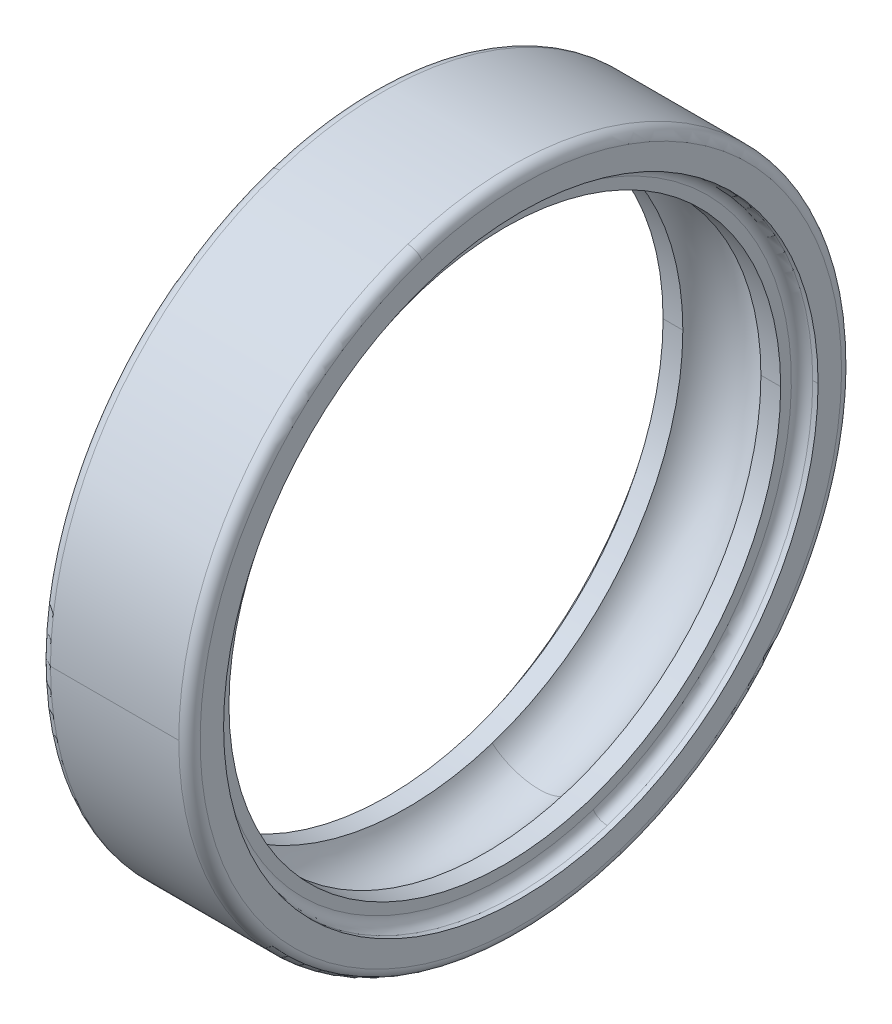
ISO-10303-21;
HEADER;
FILE_DESCRIPTION(('STEP AP214'),'2;1');
FILE_NAME('part.step','',(''),(''),'','','');
FILE_SCHEMA(('AUTOMOTIVE_DESIGN { 1 0 10303 214 1 1 1 1 }'));
ENDSEC;
DATA;
#1=APPLICATION_CONTEXT('core data for automotive mechanical design processes');
#2=APPLICATION_PROTOCOL_DEFINITION('international standard','automotive_design',2000,#1);
#3=PRODUCT_CONTEXT('',#1,'mechanical');
#4=PRODUCT('Part','Part','',(#3));
#5=PRODUCT_RELATED_PRODUCT_CATEGORY('part','',(#4));
#6=PRODUCT_DEFINITION_FORMATION('','',#4);
#7=PRODUCT_DEFINITION_CONTEXT('part definition',#1,'design');
#8=PRODUCT_DEFINITION('design','',#6,#7);
#9=PRODUCT_DEFINITION_SHAPE('','',#8);
#10=(LENGTH_UNIT() NAMED_UNIT(*) SI_UNIT(.MILLI.,.METRE.));
#11=(NAMED_UNIT(*) PLANE_ANGLE_UNIT() SI_UNIT($,.RADIAN.));
#12=(NAMED_UNIT(*) SI_UNIT($,.STERADIAN.) SOLID_ANGLE_UNIT());
#13=UNCERTAINTY_MEASURE_WITH_UNIT(LENGTH_MEASURE(1.E-05),#10,'distance_accuracy_value','');
#14=(GEOMETRIC_REPRESENTATION_CONTEXT(3) GLOBAL_UNCERTAINTY_ASSIGNED_CONTEXT((#13)) GLOBAL_UNIT_ASSIGNED_CONTEXT((#10,
#11,#12)) REPRESENTATION_CONTEXT('',''));
#15=CARTESIAN_POINT('',(0.,0.,0.));
#16=DIRECTION('',(0.,0.,1.));
#17=DIRECTION('',(1.,0.,0.));
#18=AXIS2_PLACEMENT_3D('',#15,#16,#17);
#19=CARTESIAN_POINT('',(0.99999999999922,0.,0.));
#20=DIRECTION('',(1.,0.,0.));
#21=DIRECTION('',(0.,-0.309016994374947,0.951056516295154));
#22=AXIS2_PLACEMENT_3D('',#19,#20,#21);
#23=TOROIDAL_SURFACE('',#22,30.0000000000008,0.99999999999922);
#24=CARTESIAN_POINT('',(0.99999999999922,-28.5316954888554,-9.27050983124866));
#25=DIRECTION('',(0.,0.309016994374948,-0.951056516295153));
#26=DIRECTION('',(7.80153719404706E-13,-0.951056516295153,-0.309016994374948));
#27=AXIS2_PLACEMENT_3D('',#24,#25,#26);
#28=CIRCLE('',#27,0.99999999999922);
#29=CARTESIAN_POINT('',(1.,-29.4827520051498,-9.57952682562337));
#30=VERTEX_POINT('',#29);
#31=CARTESIAN_POINT('',(0.,-28.5316954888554,-9.27050983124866));
#32=VERTEX_POINT('',#31);
#33=EDGE_CURVE('E11',#30,#32,#28,.T.);
#34=ORIENTED_EDGE('',*,*,#33,.T.);
#35=CARTESIAN_POINT('',(0.,-28.5316954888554,-9.27050983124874));
#36=CARTESIAN_POINT('',(0.,-28.3800168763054,-9.73736229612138));
#37=CARTESIAN_POINT('',(0.,-28.2168608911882,-10.200484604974));
#38=CARTESIAN_POINT('',(0.,-27.8680300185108,-11.1181694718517));
#39=CARTESIAN_POINT('',(0.,-27.6823551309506,-11.5727320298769));
#40=CARTESIAN_POINT('',(0.,-27.2889222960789,-12.4721979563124));
#41=CARTESIAN_POINT('',(0.,-27.0811643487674,-12.9171013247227));
#42=CARTESIAN_POINT('',(0.,-26.6440689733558,-13.7961782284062));
#43=CARTESIAN_POINT('',(0.,-26.4147315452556,-14.2303517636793));
#44=CARTESIAN_POINT('',(0.,-25.9350288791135,-15.0869227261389));
#45=CARTESIAN_POINT('',(0.,-25.6846636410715,-15.5093201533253));
#46=CARTESIAN_POINT('',(0.,-25.1635087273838,-16.3413213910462));
#47=CARTESIAN_POINT('',(0.,-24.8927190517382,-16.7509252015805));
#48=CARTESIAN_POINT('',(0.,-24.3313675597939,-17.5563524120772));
#49=CARTESIAN_POINT('',(0.,-24.0408057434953,-17.9521758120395));
#50=CARTESIAN_POINT('',(0.,-23.4406099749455,-18.7290886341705));
#51=CARTESIAN_POINT('',(0.,-23.1309760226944,-19.1101780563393));
#52=CARTESIAN_POINT('',(0.,-22.4933819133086,-19.8567048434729));
#53=CARTESIAN_POINT('',(0.,-22.1654217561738,-20.2221422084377));
#54=CARTESIAN_POINT('',(0.,-21.4919653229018,-20.936484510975));
#55=CARTESIAN_POINT('',(0.,-21.1464690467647,-21.2853894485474));
#56=CARTESIAN_POINT('',(0.,-20.4387727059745,-21.9658263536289));
#57=CARTESIAN_POINT('',(0.,-20.0765726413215,-22.297358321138));
#58=CARTESIAN_POINT('',(0.,-19.336341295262,-22.9422505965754));
#59=CARTESIAN_POINT('',(0.,-18.9583100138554,-23.2556109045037));
#60=CARTESIAN_POINT('',(0.,-18.1873269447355,-23.8634049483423));
#61=CARTESIAN_POINT('',(0.,-17.7943751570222,-24.1578386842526));
#62=CARTESIAN_POINT('',(0.,-16.9944977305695,-24.7270702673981));
#63=CARTESIAN_POINT('',(0.,-16.5875720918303,-25.0018681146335));
#64=CARTESIAN_POINT('',(0.,-15.7607272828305,-25.5311659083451));
#65=CARTESIAN_POINT('',(0.,-15.34080811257,-25.7856658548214));
#66=CARTESIAN_POINT('',(0.,-14.48898786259,-26.2737547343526));
#67=CARTESIAN_POINT('',(0.,-14.0570867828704,-26.5073436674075));
#68=CARTESIAN_POINT('',(0.,-13.1823432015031,-26.953047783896));
#69=CARTESIAN_POINT('',(0.,-12.7395006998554,-27.1651629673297));
#70=CARTESIAN_POINT('',(0.,-11.8439411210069,-27.5674085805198));
#71=CARTESIAN_POINT('',(0.,-11.391224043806,-27.7575390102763));
#72=CARTESIAN_POINT('',(0.,-10.4770059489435,-28.1153570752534));
#73=CARTESIAN_POINT('',(0.,-10.0155049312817,-28.283044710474));
#74=CARTESIAN_POINT('',(0.,-9.0848307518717,-28.5955732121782));
#75=CARTESIAN_POINT('',(0.,-8.61565759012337,-28.7404140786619));
#76=CARTESIAN_POINT('',(0.,-7.67076940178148,-29.0069001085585));
#77=CARTESIAN_POINT('',(0.,-7.19505437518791,-29.1285452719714));
#78=CARTESIAN_POINT('',(0.,-6.23822849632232,-29.3483468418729));
#79=CARTESIAN_POINT('',(0.,-5.75711764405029,-29.4465032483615));
#80=CARTESIAN_POINT('',(0.,-4.79065915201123,-29.6190908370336));
#81=CARTESIAN_POINT('',(0.,-4.3053115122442,-29.6935220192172));
#82=CARTESIAN_POINT('',(0.,-3.33154869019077,-29.818479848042));
#83=CARTESIAN_POINT('',(0.,-2.84313350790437,-29.8690064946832));
#84=CARTESIAN_POINT('',(0.,-1.86441223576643,-29.946033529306));
#85=CARTESIAN_POINT('',(0.,-1.3741061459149,-29.9725339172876));
#86=CARTESIAN_POINT('',(0.,-0.392784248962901,-30.0014445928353));
#87=CARTESIAN_POINT('',(0.,0.0982315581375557,-30.0038548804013));
#88=CARTESIAN_POINT('',(0.,1.0797899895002,-29.9845795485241));
#89=CARTESIAN_POINT('',(0.,1.57033261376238,-29.9628939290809));
#90=CARTESIAN_POINT('',(0.,2.54976291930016,-29.8954790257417));
#91=CARTESIAN_POINT('',(0.,3.03865060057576,-29.8497497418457));
#92=CARTESIAN_POINT('',(0.,4.01359324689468,-29.7343576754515));
#93=CARTESIAN_POINT('',(0.,4.499648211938,-29.6646948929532));
#94=CARTESIAN_POINT('',(0.,5.46775447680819,-29.501603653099));
#95=CARTESIAN_POINT('',(0.,5.94980577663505,-29.4081751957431));
#96=CARTESIAN_POINT('',(0.,6.90874340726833,-29.1977776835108));
#97=CARTESIAN_POINT('',(0.,7.38562973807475,-29.0808086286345));
#98=CARTESIAN_POINT('',(0.,8.33308856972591,-28.8236117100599));
#99=CARTESIAN_POINT('',(0.,8.80366107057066,-28.6833838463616));
#100=CARTESIAN_POINT('',(0.,9.73735859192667,-28.3800071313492));
#101=CARTESIAN_POINT('',(0.,10.2004836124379,-28.2168582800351));
#102=CARTESIAN_POINT('',(0.,11.1181704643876,-27.868032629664));
#103=CARTESIAN_POINT('',(0.,11.572732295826,-27.682355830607));
#104=CARTESIAN_POINT('',(0.,12.4721976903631,-27.2889215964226));
#105=CARTESIAN_POINT('',(0.,12.9171012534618,-27.0811641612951));
#106=CARTESIAN_POINT('',(0.,13.796178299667,-26.6440691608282));
#107=CARTESIAN_POINT('',(0.,14.2303517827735,-26.4147315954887));
#108=CARTESIAN_POINT('',(0.,15.0869227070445,-25.9350288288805));
#109=CARTESIAN_POINT('',(0.,15.509320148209,-25.6846636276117));
#110=CARTESIAN_POINT('',(0.,16.3413213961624,-25.1635087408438));
#111=CARTESIAN_POINT('',(0.,16.7509252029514,-24.8927190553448));
#112=CARTESIAN_POINT('',(0.,17.5563524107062,-24.3313675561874));
#113=CARTESIAN_POINT('',(0.,17.9521758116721,-24.0408057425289));
#114=CARTESIAN_POINT('',(0.,18.7290886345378,-23.440609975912));
#115=CARTESIAN_POINT('',(0.,19.1101780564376,-23.1309760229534));
#116=CARTESIAN_POINT('',(0.,19.8567048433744,-22.4933819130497));
#117=CARTESIAN_POINT('',(0.,20.2221422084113,-22.1654217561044));
#118=CARTESIAN_POINT('',(0.,20.9364845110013,-21.4919653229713));
#119=CARTESIAN_POINT('',(0.,21.2853894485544,-21.1464690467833));
#120=CARTESIAN_POINT('',(0.,21.9658263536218,-20.438772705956));
#121=CARTESIAN_POINT('',(0.,22.2973583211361,-20.0765726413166));
#122=CARTESIAN_POINT('',(0.,22.9422505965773,-19.336341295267));
#123=CARTESIAN_POINT('',(0.,23.2556109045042,-18.9583100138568));
#124=CARTESIAN_POINT('',(0.,23.8634049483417,-18.1873269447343));
#125=CARTESIAN_POINT('',(0.,24.1578386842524,-17.7943751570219));
#126=CARTESIAN_POINT('',(0.,24.7270702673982,-16.99449773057));
#127=CARTESIAN_POINT('',(0.,25.0018681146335,-16.5875720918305));
#128=CARTESIAN_POINT('',(0.,25.531165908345,-15.7607272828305));
#129=CARTESIAN_POINT('',(0.,25.7856658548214,-15.3408081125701));
#130=CARTESIAN_POINT('',(0.,26.2737547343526,-14.4889878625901));
#131=CARTESIAN_POINT('',(0.,26.5073436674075,-14.0570867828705));
#132=CARTESIAN_POINT('',(0.,26.953047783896,-13.1823432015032));
#133=CARTESIAN_POINT('',(0.,27.1651629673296,-12.7395006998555));
#134=CARTESIAN_POINT('',(0.,27.5674085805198,-11.843941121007));
#135=CARTESIAN_POINT('',(0.,27.7575390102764,-11.3912240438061));
#136=CARTESIAN_POINT('',(0.,28.1153570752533,-10.4770059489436));
#137=CARTESIAN_POINT('',(0.,28.2830447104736,-10.0155049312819));
#138=CARTESIAN_POINT('',(0.,28.5955732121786,-9.08483075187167));
#139=CARTESIAN_POINT('',(0.,28.7404140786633,-8.61565759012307));
#140=CARTESIAN_POINT('',(0.,29.0069001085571,-7.67076940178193));
#141=CARTESIAN_POINT('',(0.,29.1285452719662,-7.19505437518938));
#142=CARTESIAN_POINT('',(0.,29.348346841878,-6.238228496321));
#143=CARTESIAN_POINT('',(0.,29.4465032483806,-5.75711764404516));
#144=CARTESIAN_POINT('',(0.,29.6190908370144,-4.79065915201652));
#145=CARTESIAN_POINT('',(0.,29.6935220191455,-4.30531151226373));
#146=CARTESIAN_POINT('',(0.,29.8184798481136,-3.33154869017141));
#147=CARTESIAN_POINT('',(0.,29.8690064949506,-2.84313350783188));
#148=CARTESIAN_POINT('',(0.,29.9460335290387,-1.8644122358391));
#149=CARTESIAN_POINT('',(0.,29.9725339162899,-1.37410614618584));
#150=CARTESIAN_POINT('',(0.,30.001444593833,-0.392784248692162));
#151=CARTESIAN_POINT('',(0.,30.0038548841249,0.0982315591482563));
#152=CARTESIAN_POINT('',(0.,29.9845795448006,1.0797899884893));
#153=CARTESIAN_POINT('',(0.,29.9628939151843,1.57033260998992));
#154=CARTESIAN_POINT('',(0.,29.8954790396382,2.54976292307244));
#155=CARTESIAN_POINT('',(0.,29.8497497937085,3.03865061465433));
#156=CARTESIAN_POINT('',(0.,29.7343576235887,4.01359323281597));
#157=CARTESIAN_POINT('',(0.,29.6646946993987,4.4996481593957));
#158=CARTESIAN_POINT('',(0.,29.5016038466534,5.46775452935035));
#159=CARTESIAN_POINT('',(0.,29.408175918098,5.94980597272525));
#160=CARTESIAN_POINT('',(0.,29.1977769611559,6.90874321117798));
#161=CARTESIAN_POINT('',(0.,29.0808059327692,7.38562900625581));
#162=CARTESIAN_POINT('',(0.,28.8236144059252,8.33308930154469));
#163=CARTESIAN_POINT('',(0.,28.6833939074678,8.80366380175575));
#164=CARTESIAN_POINT('',(0.,28.5316954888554,9.27050983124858));
#165=B_SPLINE_CURVE_WITH_KNOTS('',3,(#35,#36,#37,#38,#39,#40,#41,#42,#43,#44,#45,#46,#47,#48,
#49,#50,#51,#52,#53,#54,#55,#56,#57,#58,#59,#60,#61,#62,#63,#64,#65,#66,#67,#68,#69,#70,#71,#72,
#73,#74,#75,#76,#77,#78,#79,#80,#81,#82,#83,#84,#85,#86,#87,#88,#89,#90,#91,#92,#93,#94,#95,#96,
#97,#98,#99,#100,#101,#102,#103,#104,#105,#106,#107,#108,#109,#110,#111,#112,#113,#114,#115,
#116,#117,#118,#119,#120,#121,#122,#123,#124,#125,#126,#127,#128,#129,#130,#131,#132,#133,#134,
#135,#136,#137,#138,#139,#140,#141,#142,#143,#144,#145,#146,#147,#148,#149,#150,#151,#152,#153,
#154,#155,#156,#157,#158,#159,#160,#161,#162,#163,#164),.UNSPECIFIED.,.F.,.F.,(4,2,2,2,2,2,2,2,
2,2,2,2,2,2,2,2,2,2,2,2,2,2,2,2,2,2,2,2,2,2,2,2,2,2,2,2,2,2,2,2,2,2,2,2,2,2,2,2,2,2,2,2,2,2,2,2,
2,2,2,2,2,2,2,2,4),(0.,1.47247371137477,2.94494742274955,4.41742113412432,5.8898948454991,
7.36236855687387,8.83484226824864,10.3073159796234,11.7797896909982,13.252263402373,
14.7247371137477,16.1972108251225,17.6696845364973,19.1421582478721,20.6146319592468,
22.0871056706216,23.5595793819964,25.0320530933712,26.5045268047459,27.9770005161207,
29.4494742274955,30.9219479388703,32.394421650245,33.8668953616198,35.3393690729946,
36.8118427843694,38.2843164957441,39.7567902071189,41.2292639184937,42.7017376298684,
44.1742113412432,45.646685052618,47.1191587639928,48.5916324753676,50.0641061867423,
51.5365798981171,53.0090536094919,54.4815273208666,55.9540010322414,57.4264747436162,
58.898948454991,60.3714221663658,61.8438958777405,63.3163695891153,64.7888433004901,
66.2613170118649,67.7337907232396,69.2062644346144,70.6787381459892,72.151211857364,
73.6236855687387,75.0961592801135,76.5686329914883,78.041106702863,79.5135804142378,
80.9860541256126,82.4585278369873,83.9310015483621,85.4034752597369,86.8759489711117,
88.3484226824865,89.8208963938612,91.293370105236,92.7658438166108,94.2383175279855),.UNSPECIFIED.);
#166=CARTESIAN_POINT('',(0.,28.5316954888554,9.27050983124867));
#167=VERTEX_POINT('',#166);
#168=EDGE_CURVE('E26',#32,#167,#165,.T.);
#169=ORIENTED_EDGE('',*,*,#168,.T.);
#170=CARTESIAN_POINT('',(0.99999999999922,28.5316954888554,9.27050983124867));
#171=DIRECTION('',(0.,-0.309016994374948,0.951056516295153));
#172=DIRECTION('',(7.80153719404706E-13,0.951056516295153,0.309016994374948));
#173=AXIS2_PLACEMENT_3D('',#170,#171,#172);
#174=CIRCLE('',#173,0.99999999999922);
#175=CARTESIAN_POINT('',(1.,29.4827520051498,9.57952682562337));
#176=VERTEX_POINT('',#175);
#177=EDGE_CURVE('E529',#176,#167,#174,.T.);
#178=ORIENTED_EDGE('',*,*,#177,.F.);
#179=CARTESIAN_POINT('',(1.,0.,0.));
#180=DIRECTION('',(1.,0.,0.));
#181=DIRECTION('',(0.,0.,-1.));
#182=AXIS2_PLACEMENT_3D('',#179,#180,#181);
#183=CIRCLE('',#182,31.);
#184=CARTESIAN_POINT('',(1.,0.,-31.));
#185=VERTEX_POINT('',#184);
#186=EDGE_CURVE('E524',#185,#176,#183,.T.);
#187=ORIENTED_EDGE('',*,*,#186,.F.);
#188=CARTESIAN_POINT('',(1.,0.,0.));
#189=DIRECTION('',(1.,0.,0.));
#190=DIRECTION('',(0.,0.,-1.));
#191=AXIS2_PLACEMENT_3D('',#188,#189,#190);
#192=CIRCLE('',#191,31.);
#193=EDGE_CURVE('E519',#30,#185,#192,.T.);
#194=ORIENTED_EDGE('',*,*,#193,.F.);
#195=EDGE_LOOP('',(#34,#169,#178,#187,#194));
#196=FACE_BOUND('',#195,.T.);
#197=ADVANCED_FACE('F17',(#196),#23,.T.);
#198=CARTESIAN_POINT('',(50.,0.,0.));
#199=DIRECTION('',(1.,0.,0.));
#200=DIRECTION('',(0.,1.,0.));
#201=AXIS2_PLACEMENT_3D('',#198,#199,#200);
#202=CYLINDRICAL_SURFACE('',#201,31.);
#203=DIRECTION('',(1.,0.,0.));
#204=VECTOR('',#203,1.);
#205=CARTESIAN_POINT('',(1.,0.,31.));
#206=LINE('',#205,#204);
#207=CARTESIAN_POINT('',(1.,0.,31.));
#208=VERTEX_POINT('',#207);
#209=CARTESIAN_POINT('',(13.,0.,31.));
#210=VERTEX_POINT('',#209);
#211=EDGE_CURVE('E514',#208,#210,#206,.T.);
#212=ORIENTED_EDGE('',*,*,#211,.F.);
#213=CARTESIAN_POINT('',(1.,0.,0.));
#214=DIRECTION('',(1.,0.,0.));
#215=DIRECTION('',(0.,0.,-1.));
#216=AXIS2_PLACEMENT_3D('',#213,#214,#215);
#217=CIRCLE('',#216,31.);
#218=EDGE_CURVE('E509',#208,#30,#217,.T.);
#219=ORIENTED_EDGE('',*,*,#218,.T.);
#220=ORIENTED_EDGE('',*,*,#193,.T.);
#221=DIRECTION('',(1.,0.,0.));
#222=VECTOR('',#221,1.);
#223=CARTESIAN_POINT('',(1.,0.,-31.));
#224=LINE('',#223,#222);
#225=CARTESIAN_POINT('',(13.,0.,-31.));
#226=VERTEX_POINT('',#225);
#227=EDGE_CURVE('E505',#185,#226,#224,.T.);
#228=ORIENTED_EDGE('',*,*,#227,.T.);
#229=CARTESIAN_POINT('',(13.,0.,0.));
#230=DIRECTION('',(1.,0.,0.));
#231=DIRECTION('',(0.,0.,-1.));
#232=AXIS2_PLACEMENT_3D('',#229,#230,#231);
#233=CIRCLE('',#232,31.);
#234=CARTESIAN_POINT('',(13.,-29.4827520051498,-9.57952682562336));
#235=VERTEX_POINT('',#234);
#236=EDGE_CURVE('E500',#235,#226,#233,.T.);
#237=ORIENTED_EDGE('',*,*,#236,.F.);
#238=CARTESIAN_POINT('',(13.,0.,0.));
#239=DIRECTION('',(1.,0.,0.));
#240=DIRECTION('',(0.,0.,-1.));
#241=AXIS2_PLACEMENT_3D('',#238,#239,#240);
#242=CIRCLE('',#241,31.);
#243=EDGE_CURVE('E495',#210,#235,#242,.T.);
#244=ORIENTED_EDGE('',*,*,#243,.F.);
#245=EDGE_LOOP('',(#212,#219,#220,#228,#237,#244));
#246=FACE_BOUND('',#245,.T.);
#247=ADVANCED_FACE('F550',(#246),#202,.T.);
#248=CARTESIAN_POINT('',(13.0000000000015,0.,0.));
#249=DIRECTION('',(1.,0.,0.));
#250=DIRECTION('',(0.,0.309016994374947,-0.951056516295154));
#251=AXIS2_PLACEMENT_3D('',#248,#249,#250);
#252=TOROIDAL_SURFACE('',#251,30.0000000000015,0.999999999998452);
#253=CARTESIAN_POINT('',(13.0000000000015,-28.5316954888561,-9.2705098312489));
#254=DIRECTION('',(0.,0.309016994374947,-0.951056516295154));
#255=DIRECTION('',(1.,0.,0.));
#256=AXIS2_PLACEMENT_3D('',#253,#254,#255);
#257=CIRCLE('',#256,0.999999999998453);
#258=CARTESIAN_POINT('',(14.,-28.5316954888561,-9.2705098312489));
#259=VERTEX_POINT('',#258);
#260=EDGE_CURVE('E490',#259,#235,#257,.T.);
#261=ORIENTED_EDGE('',*,*,#260,.F.);
#262=CARTESIAN_POINT('',(14.,0.,0.));
#263=DIRECTION('',(1.,0.,0.));
#264=DIRECTION('',(0.,0.,-1.));
#265=AXIS2_PLACEMENT_3D('',#262,#263,#264);
#266=CIRCLE('',#265,30.);
#267=CARTESIAN_POINT('',(14.,28.5316954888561,9.2705098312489));
#268=VERTEX_POINT('',#267);
#269=EDGE_CURVE('E485',#268,#259,#266,.T.);
#270=ORIENTED_EDGE('',*,*,#269,.F.);
#271=CARTESIAN_POINT('',(13.0000000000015,28.5316954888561,9.2705098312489));
#272=DIRECTION('',(0.,-0.309016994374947,0.951056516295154));
#273=DIRECTION('',(1.,0.,0.));
#274=AXIS2_PLACEMENT_3D('',#271,#272,#273);
#275=CIRCLE('',#274,0.999999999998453);
#276=CARTESIAN_POINT('',(13.,29.4827520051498,9.57952682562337));
#277=VERTEX_POINT('',#276);
#278=EDGE_CURVE('E481',#268,#277,#275,.T.);
#279=ORIENTED_EDGE('',*,*,#278,.T.);
#280=CARTESIAN_POINT('',(13.,0.,0.));
#281=DIRECTION('',(1.,0.,0.));
#282=DIRECTION('',(0.,0.,-1.));
#283=AXIS2_PLACEMENT_3D('',#280,#281,#282);
#284=CIRCLE('',#283,31.);
#285=EDGE_CURVE('E476',#277,#210,#284,.T.);
#286=ORIENTED_EDGE('',*,*,#285,.T.);
#287=ORIENTED_EDGE('',*,*,#243,.T.);
#288=EDGE_LOOP('',(#261,#270,#279,#286,#287));
#289=FACE_BOUND('',#288,.T.);
#290=ADVANCED_FACE('F552',(#289),#252,.T.);
#291=CARTESIAN_POINT('',(50.,0.,0.));
#292=DIRECTION('',(1.,0.,0.));
#293=DIRECTION('',(0.,-1.,0.));
#294=AXIS2_PLACEMENT_3D('',#291,#292,#293);
#295=CYLINDRICAL_SURFACE('',#294,31.);
#296=ORIENTED_EDGE('',*,*,#211,.T.);
#297=ORIENTED_EDGE('',*,*,#285,.F.);
#298=CARTESIAN_POINT('',(13.,0.,0.));
#299=DIRECTION('',(1.,0.,0.));
#300=DIRECTION('',(0.,0.,-1.));
#301=AXIS2_PLACEMENT_3D('',#298,#299,#300);
#302=CIRCLE('',#301,31.);
#303=EDGE_CURVE('E471',#226,#277,#302,.T.);
#304=ORIENTED_EDGE('',*,*,#303,.F.);
#305=ORIENTED_EDGE('',*,*,#227,.F.);
#306=ORIENTED_EDGE('',*,*,#186,.T.);
#307=CARTESIAN_POINT('',(1.,0.,0.));
#308=DIRECTION('',(1.,0.,0.));
#309=DIRECTION('',(0.,0.,-1.));
#310=AXIS2_PLACEMENT_3D('',#307,#308,#309);
#311=CIRCLE('',#310,31.);
#312=EDGE_CURVE('E468',#176,#208,#311,.T.);
#313=ORIENTED_EDGE('',*,*,#312,.T.);
#314=EDGE_LOOP('',(#296,#297,#304,#305,#306,#313));
#315=FACE_BOUND('',#314,.T.);
#316=ADVANCED_FACE('F546',(#315),#295,.T.);
#317=CARTESIAN_POINT('',(0.99999999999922,0.,0.));
#318=DIRECTION('',(1.,0.,0.));
#319=DIRECTION('',(0.,0.309016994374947,-0.951056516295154));
#320=AXIS2_PLACEMENT_3D('',#317,#318,#319);
#321=TOROIDAL_SURFACE('',#320,30.0000000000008,0.99999999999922);
#322=ORIENTED_EDGE('',*,*,#33,.F.);
#323=ORIENTED_EDGE('',*,*,#218,.F.);
#324=ORIENTED_EDGE('',*,*,#312,.F.);
#325=ORIENTED_EDGE('',*,*,#177,.T.);
#326=CARTESIAN_POINT('',(0.,28.5316954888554,9.27050983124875));
#327=CARTESIAN_POINT('',(0.,28.3800168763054,9.73736229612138));
#328=CARTESIAN_POINT('',(0.,28.2168608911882,10.200484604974));
#329=CARTESIAN_POINT('',(0.,27.8680300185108,11.1181694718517));
#330=CARTESIAN_POINT('',(0.,27.6823551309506,11.5727320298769));
#331=CARTESIAN_POINT('',(0.,27.2889222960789,12.4721979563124));
#332=CARTESIAN_POINT('',(0.,27.0811643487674,12.9171013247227));
#333=CARTESIAN_POINT('',(0.,26.6440689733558,13.7961782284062));
#334=CARTESIAN_POINT('',(0.,26.4147315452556,14.2303517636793));
#335=CARTESIAN_POINT('',(0.,25.9350288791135,15.0869227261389));
#336=CARTESIAN_POINT('',(0.,25.6846636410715,15.5093201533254));
#337=CARTESIAN_POINT('',(0.,25.1635087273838,16.3413213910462));
#338=CARTESIAN_POINT('',(0.,24.8927190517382,16.7509252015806));
#339=CARTESIAN_POINT('',(0.,24.3313675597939,17.5563524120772));
#340=CARTESIAN_POINT('',(0.,24.0408057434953,17.9521758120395));
#341=CARTESIAN_POINT('',(0.,23.4406099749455,18.7290886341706));
#342=CARTESIAN_POINT('',(0.,23.1309760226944,19.1101780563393));
#343=CARTESIAN_POINT('',(0.,22.4933819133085,19.8567048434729));
#344=CARTESIAN_POINT('',(0.,22.1654217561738,20.2221422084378));
#345=CARTESIAN_POINT('',(0.,21.4919653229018,20.936484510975));
#346=CARTESIAN_POINT('',(0.,21.1464690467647,21.2853894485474));
#347=CARTESIAN_POINT('',(0.,20.4387727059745,21.9658263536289));
#348=CARTESIAN_POINT('',(0.,20.0765726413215,22.297358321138));
#349=CARTESIAN_POINT('',(0.,19.3363412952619,22.9422505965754));
#350=CARTESIAN_POINT('',(0.,18.9583100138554,23.2556109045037));
#351=CARTESIAN_POINT('',(0.,18.1873269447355,23.8634049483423));
#352=CARTESIAN_POINT('',(0.,17.7943751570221,24.1578386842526));
#353=CARTESIAN_POINT('',(0.,16.9944977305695,24.7270702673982));
#354=CARTESIAN_POINT('',(0.,16.5875720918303,25.0018681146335));
#355=CARTESIAN_POINT('',(0.,15.7607272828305,25.5311659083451));
#356=CARTESIAN_POINT('',(0.,15.34080811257,25.7856658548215));
#357=CARTESIAN_POINT('',(0.,14.4889878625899,26.2737547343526));
#358=CARTESIAN_POINT('',(0.,14.0570867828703,26.5073436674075));
#359=CARTESIAN_POINT('',(0.,13.1823432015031,26.953047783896));
#360=CARTESIAN_POINT('',(0.,12.7395006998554,27.1651629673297));
#361=CARTESIAN_POINT('',(0.,11.8439411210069,27.5674085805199));
#362=CARTESIAN_POINT('',(0.,11.391224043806,27.7575390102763));
#363=CARTESIAN_POINT('',(0.,10.4770059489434,28.1153570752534));
#364=CARTESIAN_POINT('',(0.,10.0155049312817,28.283044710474));
#365=CARTESIAN_POINT('',(0.,9.08483075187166,28.5955732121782));
#366=CARTESIAN_POINT('',(0.,8.61565759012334,28.7404140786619));
#367=CARTESIAN_POINT('',(0.,7.67076940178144,29.0069001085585));
#368=CARTESIAN_POINT('',(0.,7.19505437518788,29.1285452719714));
#369=CARTESIAN_POINT('',(0.,6.23822849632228,29.3483468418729));
#370=CARTESIAN_POINT('',(0.,5.75711764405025,29.4465032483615));
#371=CARTESIAN_POINT('',(0.,4.79065915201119,29.6190908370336));
#372=CARTESIAN_POINT('',(0.,4.30531151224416,29.6935220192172));
#373=CARTESIAN_POINT('',(0.,3.33154869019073,29.818479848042));
#374=CARTESIAN_POINT('',(0.,2.84313350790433,29.8690064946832));
#375=CARTESIAN_POINT('',(0.,1.86441223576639,29.9460335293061));
#376=CARTESIAN_POINT('',(0.,1.37410614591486,29.9725339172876));
#377=CARTESIAN_POINT('',(0.,0.392784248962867,30.0014445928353));
#378=CARTESIAN_POINT('',(0.,-0.0982315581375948,30.0038548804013));
#379=CARTESIAN_POINT('',(0.,-1.07978998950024,29.9845795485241));
#380=CARTESIAN_POINT('',(0.,-1.57033261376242,29.9628939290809));
#381=CARTESIAN_POINT('',(0.,-2.54976291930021,29.8954790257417));
#382=CARTESIAN_POINT('',(0.,-3.03865060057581,29.8497497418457));
#383=CARTESIAN_POINT('',(0.,-4.01359324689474,29.7343576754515));
#384=CARTESIAN_POINT('',(0.,-4.49964821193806,29.6646948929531));
#385=CARTESIAN_POINT('',(0.,-5.46775447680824,29.5016036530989));
#386=CARTESIAN_POINT('',(0.,-5.94980577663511,29.4081751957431));
#387=CARTESIAN_POINT('',(0.,-6.90874340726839,29.1977776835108));
#388=CARTESIAN_POINT('',(0.,-7.38562973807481,29.0808086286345));
#389=CARTESIAN_POINT('',(0.,-8.33308856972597,28.8236117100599));
#390=CARTESIAN_POINT('',(0.,-8.80366107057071,28.6833838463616));
#391=CARTESIAN_POINT('',(0.,-9.73735859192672,28.3800071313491));
#392=CARTESIAN_POINT('',(0.,-10.200483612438,28.216858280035));
#393=CARTESIAN_POINT('',(0.,-11.1181704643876,27.868032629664));
#394=CARTESIAN_POINT('',(0.,-11.572732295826,27.682355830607));
#395=CARTESIAN_POINT('',(0.,-12.4721976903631,27.2889215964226));
#396=CARTESIAN_POINT('',(0.,-12.9171012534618,27.0811641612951));
#397=CARTESIAN_POINT('',(0.,-13.7961782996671,26.6440691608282));
#398=CARTESIAN_POINT('',(0.,-14.2303517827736,26.4147315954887));
#399=CARTESIAN_POINT('',(0.,-15.0869227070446,25.9350288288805));
#400=CARTESIAN_POINT('',(0.,-15.509320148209,25.6846636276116));
#401=CARTESIAN_POINT('',(0.,-16.3413213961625,25.1635087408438));
#402=CARTESIAN_POINT('',(0.,-16.7509252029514,24.8927190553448));
#403=CARTESIAN_POINT('',(0.,-17.5563524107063,24.3313675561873));
#404=CARTESIAN_POINT('',(0.,-17.9521758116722,24.0408057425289));
#405=CARTESIAN_POINT('',(0.,-18.7290886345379,23.4406099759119));
#406=CARTESIAN_POINT('',(0.,-19.1101780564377,23.1309760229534));
#407=CARTESIAN_POINT('',(0.,-19.8567048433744,22.4933819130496));
#408=CARTESIAN_POINT('',(0.,-20.2221422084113,22.1654217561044));
#409=CARTESIAN_POINT('',(0.,-20.9364845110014,21.4919653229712));
#410=CARTESIAN_POINT('',(0.,-21.2853894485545,21.1464690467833));
#411=CARTESIAN_POINT('',(0.,-21.9658263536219,20.4387727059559));
#412=CARTESIAN_POINT('',(0.,-22.2973583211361,20.0765726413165));
#413=CARTESIAN_POINT('',(0.,-22.9422505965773,19.3363412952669));
#414=CARTESIAN_POINT('',(0.,-23.2556109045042,18.9583100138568));
#415=CARTESIAN_POINT('',(0.,-23.8634049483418,18.1873269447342));
#416=CARTESIAN_POINT('',(0.,-24.1578386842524,17.7943751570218));
#417=CARTESIAN_POINT('',(0.,-24.7270702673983,16.9944977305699));
#418=CARTESIAN_POINT('',(0.,-25.0018681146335,16.5875720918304));
#419=CARTESIAN_POINT('',(0.,-25.5311659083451,15.7607272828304));
#420=CARTESIAN_POINT('',(0.,-25.7856658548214,15.34080811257));
#421=CARTESIAN_POINT('',(0.,-26.2737547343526,14.48898786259));
#422=CARTESIAN_POINT('',(0.,-26.5073436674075,14.0570867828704));
#423=CARTESIAN_POINT('',(0.,-26.953047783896,13.1823432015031));
#424=CARTESIAN_POINT('',(0.,-27.1651629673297,12.7395006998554));
#425=CARTESIAN_POINT('',(0.,-27.5674085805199,11.8439411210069));
#426=CARTESIAN_POINT('',(0.,-27.7575390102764,11.391224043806));
#427=CARTESIAN_POINT('',(0.,-28.1153570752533,10.4770059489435));
#428=CARTESIAN_POINT('',(0.,-28.2830447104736,10.0155049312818));
#429=CARTESIAN_POINT('',(0.,-28.5955732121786,9.08483075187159));
#430=CARTESIAN_POINT('',(0.,-28.7404140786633,8.61565759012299));
#431=CARTESIAN_POINT('',(0.,-29.0069001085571,7.67076940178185));
#432=CARTESIAN_POINT('',(0.,-29.1285452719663,7.1950543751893));
#433=CARTESIAN_POINT('',(0.,-29.348346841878,6.23822849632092));
#434=CARTESIAN_POINT('',(0.,-29.4465032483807,5.75711764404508));
#435=CARTESIAN_POINT('',(0.,-29.6190908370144,4.79065915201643));
#436=CARTESIAN_POINT('',(0.,-29.6935220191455,4.30531151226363));
#437=CARTESIAN_POINT('',(0.,-29.8184798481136,3.3315486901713));
#438=CARTESIAN_POINT('',(0.,-29.8690064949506,2.84313350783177));
#439=CARTESIAN_POINT('',(0.,-29.9460335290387,1.86441223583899));
#440=CARTESIAN_POINT('',(0.,-29.9725339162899,1.37410614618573));
#441=CARTESIAN_POINT('',(0.,-30.001444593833,0.392784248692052));
#442=CARTESIAN_POINT('',(0.,-30.0038548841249,-0.0982315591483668));
#443=CARTESIAN_POINT('',(0.,-29.9845795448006,-1.07978998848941));
#444=CARTESIAN_POINT('',(0.,-29.9628939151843,-1.57033260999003));
#445=CARTESIAN_POINT('',(0.,-29.8954790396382,-2.54976292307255));
#446=CARTESIAN_POINT('',(0.,-29.8497497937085,-3.03865061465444));
#447=CARTESIAN_POINT('',(0.,-29.7343576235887,-4.01359323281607));
#448=CARTESIAN_POINT('',(0.,-29.6646946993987,-4.49964815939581));
#449=CARTESIAN_POINT('',(0.,-29.5016038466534,-5.46775452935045));
#450=CARTESIAN_POINT('',(0.,-29.408175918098,-5.94980597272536));
#451=CARTESIAN_POINT('',(0.,-29.1977769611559,-6.90874321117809));
#452=CARTESIAN_POINT('',(0.,-29.0808059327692,-7.38562900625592));
#453=CARTESIAN_POINT('',(0.,-28.8236144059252,-8.3330893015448));
#454=CARTESIAN_POINT('',(0.,-28.6833939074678,-8.80366380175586));
#455=CARTESIAN_POINT('',(0.,-28.5316954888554,-9.27050983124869));
#456=B_SPLINE_CURVE_WITH_KNOTS('',3,(#326,#327,#328,#329,#330,#331,#332,#333,#334,#335,#336,
#337,#338,#339,#340,#341,#342,#343,#344,#345,#346,#347,#348,#349,#350,#351,#352,#353,#354,#355,
#356,#357,#358,#359,#360,#361,#362,#363,#364,#365,#366,#367,#368,#369,#370,#371,#372,#373,#374,
#375,#376,#377,#378,#379,#380,#381,#382,#383,#384,#385,#386,#387,#388,#389,#390,#391,#392,#393,
#394,#395,#396,#397,#398,#399,#400,#401,#402,#403,#404,#405,#406,#407,#408,#409,#410,#411,#412,
#413,#414,#415,#416,#417,#418,#419,#420,#421,#422,#423,#424,#425,#426,#427,#428,#429,#430,#431,
#432,#433,#434,#435,#436,#437,#438,#439,#440,#441,#442,#443,#444,#445,#446,#447,#448,#449,#450,
#451,#452,#453,#454,#455),.UNSPECIFIED.,.F.,.F.,(4,2,2,2,2,2,2,2,2,2,2,2,2,2,2,2,2,2,2,2,2,2,2,
2,2,2,2,2,2,2,2,2,2,2,2,2,2,2,2,2,2,2,2,2,2,2,2,2,2,2,2,2,2,2,2,2,2,2,2,2,2,2,2,2,4),(0.,
1.47247371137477,2.94494742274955,4.41742113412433,5.88989484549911,7.36236855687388,
8.83484226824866,10.3073159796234,11.7797896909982,13.252263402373,14.7247371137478,
16.1972108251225,17.6696845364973,19.1421582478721,20.6146319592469,22.0871056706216,
23.5595793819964,25.0320530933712,26.504526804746,27.9770005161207,29.4494742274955,
30.9219479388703,32.3944216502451,33.8668953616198,35.3393690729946,36.8118427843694,
38.2843164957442,39.7567902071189,41.2292639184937,42.7017376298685,44.1742113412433,
45.6466850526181,47.1191587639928,48.5916324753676,50.0641061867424,51.5365798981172,
53.0090536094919,54.4815273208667,55.9540010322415,57.4264747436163,58.8989484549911,
60.3714221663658,61.8438958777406,63.3163695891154,64.7888433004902,66.2613170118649,
67.7337907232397,69.2062644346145,70.6787381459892,72.151211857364,73.6236855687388,
75.0961592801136,76.5686329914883,78.0411067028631,79.5135804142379,80.9860541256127,
82.4585278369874,83.9310015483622,85.403475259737,86.8759489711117,88.3484226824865,
89.8208963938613,91.2933701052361,92.7658438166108,94.2383175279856),.UNSPECIFIED.);
#457=EDGE_CURVE('E454',#167,#32,#456,.T.);
#458=ORIENTED_EDGE('',*,*,#457,.T.);
#459=EDGE_LOOP('',(#322,#323,#324,#325,#458));
#460=FACE_BOUND('',#459,.T.);
#461=ADVANCED_FACE('F434',(#460),#321,.T.);
#462=CARTESIAN_POINT('',(0.,30.,0.));
#463=DIRECTION('',(-1.,0.,0.));
#464=DIRECTION('',(0.,0.,1.));
#465=AXIS2_PLACEMENT_3D('',#462,#463,#464);
#466=PLANE('',#465);
#467=CARTESIAN_POINT('',(0.,0.,0.));
#468=DIRECTION('',(1.,0.,0.));
#469=DIRECTION('',(0.,0.,-1.));
#470=AXIS2_PLACEMENT_3D('',#467,#468,#469);
#471=CIRCLE('',#470,27.805);
#472=CARTESIAN_POINT('',(0.,0.,-27.805));
#473=VERTEX_POINT('',#472);
#474=CARTESIAN_POINT('',(0.,0.,27.805));
#475=VERTEX_POINT('',#474);
#476=EDGE_CURVE('E450',#473,#475,#471,.T.);
#477=ORIENTED_EDGE('',*,*,#476,.T.);
#478=CARTESIAN_POINT('',(0.,0.,0.));
#479=DIRECTION('',(1.,0.,0.));
#480=DIRECTION('',(0.,0.,-1.));
#481=AXIS2_PLACEMENT_3D('',#478,#479,#480);
#482=CIRCLE('',#481,27.805);
#483=EDGE_CURVE('E415',#475,#473,#482,.T.);
#484=ORIENTED_EDGE('',*,*,#483,.T.);
#485=EDGE_LOOP('',(#477,#484));
#486=FACE_BOUND('',#485,.T.);
#487=ORIENTED_EDGE('',*,*,#168,.F.);
#488=ORIENTED_EDGE('',*,*,#457,.F.);
#489=EDGE_LOOP('',(#487,#488));
#490=FACE_BOUND('',#489,.T.);
#491=ADVANCED_FACE('F423',(#486,#490),#466,.T.);
#492=CARTESIAN_POINT('',(50.,0.,0.));
#493=DIRECTION('',(1.,0.,0.));
#494=DIRECTION('',(0.,1.,0.));
#495=AXIS2_PLACEMENT_3D('',#492,#493,#494);
#496=CYLINDRICAL_SURFACE('',#495,27.805);
#497=DIRECTION('',(1.,0.,0.));
#498=VECTOR('',#497,1.);
#499=CARTESIAN_POINT('',(0.,0.,27.805));
#500=LINE('',#499,#498);
#501=CARTESIAN_POINT('',(0.5,0.,27.805));
#502=VERTEX_POINT('',#501);
#503=EDGE_CURVE('E411',#475,#502,#500,.T.);
#504=ORIENTED_EDGE('',*,*,#503,.T.);
#505=CARTESIAN_POINT('',(0.5,0.,0.));
#506=DIRECTION('',(1.,0.,0.));
#507=DIRECTION('',(0.,0.,-1.));
#508=AXIS2_PLACEMENT_3D('',#505,#506,#507);
#509=CIRCLE('',#508,27.805);
#510=CARTESIAN_POINT('',(0.499999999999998,-26.4441264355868,-8.59221752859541));
#511=VERTEX_POINT('',#510);
#512=EDGE_CURVE('E407',#502,#511,#509,.T.);
#513=ORIENTED_EDGE('',*,*,#512,.T.);
#514=CARTESIAN_POINT('',(0.5,0.,0.));
#515=DIRECTION('',(1.,0.,0.));
#516=DIRECTION('',(0.,0.,-1.));
#517=AXIS2_PLACEMENT_3D('',#514,#515,#516);
#518=CIRCLE('',#517,27.805);
#519=CARTESIAN_POINT('',(0.5,0.,-27.805));
#520=VERTEX_POINT('',#519);
#521=EDGE_CURVE('E403',#511,#520,#518,.T.);
#522=ORIENTED_EDGE('',*,*,#521,.T.);
#523=DIRECTION('',(1.,0.,0.));
#524=VECTOR('',#523,1.);
#525=CARTESIAN_POINT('',(0.,0.,-27.805));
#526=LINE('',#525,#524);
#527=EDGE_CURVE('E398',#473,#520,#526,.T.);
#528=ORIENTED_EDGE('',*,*,#527,.F.);
#529=ORIENTED_EDGE('',*,*,#483,.F.);
#530=EDGE_LOOP('',(#504,#513,#522,#528,#529));
#531=FACE_BOUND('',#530,.T.);
#532=ADVANCED_FACE('F433',(#531),#496,.F.);
#533=CARTESIAN_POINT('',(50.,0.,0.));
#534=DIRECTION('',(1.,0.,0.));
#535=DIRECTION('',(0.,-1.,0.));
#536=AXIS2_PLACEMENT_3D('',#533,#534,#535);
#537=CYLINDRICAL_SURFACE('',#536,27.805);
#538=ORIENTED_EDGE('',*,*,#503,.F.);
#539=ORIENTED_EDGE('',*,*,#476,.F.);
#540=ORIENTED_EDGE('',*,*,#527,.T.);
#541=CARTESIAN_POINT('',(0.5,0.,0.));
#542=DIRECTION('',(1.,0.,0.));
#543=DIRECTION('',(0.,0.,-1.));
#544=AXIS2_PLACEMENT_3D('',#541,#542,#543);
#545=CIRCLE('',#544,27.805);
#546=CARTESIAN_POINT('',(0.499999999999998,26.4441264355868,8.59221752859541));
#547=VERTEX_POINT('',#546);
#548=EDGE_CURVE('E394',#520,#547,#545,.T.);
#549=ORIENTED_EDGE('',*,*,#548,.T.);
#550=CARTESIAN_POINT('',(0.5,0.,0.));
#551=DIRECTION('',(1.,0.,0.));
#552=DIRECTION('',(0.,0.,-1.));
#553=AXIS2_PLACEMENT_3D('',#550,#551,#552);
#554=CIRCLE('',#553,27.805);
#555=EDGE_CURVE('E389',#547,#502,#554,.T.);
#556=ORIENTED_EDGE('',*,*,#555,.T.);
#557=EDGE_LOOP('',(#538,#539,#540,#549,#556));
#558=FACE_BOUND('',#557,.T.);
#559=ADVANCED_FACE('F609',(#558),#537,.F.);
#560=CARTESIAN_POINT('',(0.500000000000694,0.,0.));
#561=DIRECTION('',(1.,0.,0.));
#562=DIRECTION('',(0.,0.309016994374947,-0.951056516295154));
#563=AXIS2_PLACEMENT_3D('',#560,#561,#562);
#564=TOROIDAL_SURFACE('',#563,26.8050000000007,0.999999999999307);
#565=CARTESIAN_POINT('',(0.500000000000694,-25.4930699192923,-8.28320053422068));
#566=DIRECTION('',(0.,0.309016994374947,-0.951056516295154));
#567=DIRECTION('',(1.,0.,0.));
#568=AXIS2_PLACEMENT_3D('',#565,#566,#567);
#569=CIRCLE('',#568,0.999999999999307);
#570=CARTESIAN_POINT('',(1.5,-25.4930699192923,-8.28320053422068));
#571=VERTEX_POINT('',#570);
#572=EDGE_CURVE('E366',#571,#511,#569,.T.);
#573=ORIENTED_EDGE('',*,*,#572,.T.);
#574=ORIENTED_EDGE('',*,*,#512,.F.);
#575=ORIENTED_EDGE('',*,*,#555,.F.);
#576=CARTESIAN_POINT('',(0.500000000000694,25.4930699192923,8.28320053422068));
#577=DIRECTION('',(0.,-0.309016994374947,0.951056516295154));
#578=DIRECTION('',(1.,0.,0.));
#579=AXIS2_PLACEMENT_3D('',#576,#577,#578);
#580=CIRCLE('',#579,0.999999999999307);
#581=CARTESIAN_POINT('',(1.5,25.4930699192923,8.28320053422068));
#582=VERTEX_POINT('',#581);
#583=EDGE_CURVE('E360',#582,#547,#580,.T.);
#584=ORIENTED_EDGE('',*,*,#583,.F.);
#585=CARTESIAN_POINT('',(1.5,25.4930699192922,8.28320053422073));
#586=CARTESIAN_POINT('',(1.5,25.3575450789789,8.70033321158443));
#587=CARTESIAN_POINT('',(1.5,25.2117652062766,9.11413299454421));
#588=CARTESIAN_POINT('',(1.5,24.9000848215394,9.93408442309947));
#589=CARTESIAN_POINT('',(1.5,24.7341843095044,10.3402360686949));
#590=CARTESIAN_POINT('',(1.5,24.3826520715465,11.1439088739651));
#591=CARTESIAN_POINT('',(1.5,24.1970203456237,11.5414300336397));
#592=CARTESIAN_POINT('',(1.5,23.8064756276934,12.3268852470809));
#593=CARTESIAN_POINT('',(1.5,23.6015626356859,12.7148193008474));
#594=CARTESIAN_POINT('',(1.5,23.1729483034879,13.4801654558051));
#595=CARTESIAN_POINT('',(1.5,22.9492469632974,13.8575775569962));
#596=CARTESIAN_POINT('',(1.5,22.4835950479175,14.6009706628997));
#597=CARTESIAN_POINT('',(1.5,22.2416444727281,14.9669516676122));
#598=CARTESIAN_POINT('',(1.5,21.7400769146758,15.686600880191));
#599=CARTESIAN_POINT('',(1.5,21.480459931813,16.0402690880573));
#600=CARTESIAN_POINT('',(1.5,20.9441850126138,16.7344406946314));
#601=CARTESIAN_POINT('',(1.5,20.6675270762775,17.0749440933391));
#602=CARTESIAN_POINT('',(1.5,20.0978367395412,17.741965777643));
#603=CARTESIAN_POINT('',(1.5,19.8048043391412,18.0684840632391));
#604=CARTESIAN_POINT('',(1.5,19.2030710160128,18.7067489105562));
#605=CARTESIAN_POINT('',(1.5,18.8943700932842,19.0184954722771));
#606=CARTESIAN_POINT('',(1.5,18.2620434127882,19.6264658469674));
#607=CARTESIAN_POINT('',(1.5,17.9384176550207,19.9226896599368));
#608=CARTESIAN_POINT('',(1.5,17.2770209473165,20.4989009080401));
#609=CARTESIAN_POINT('',(1.5,16.9392499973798,20.7788883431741));
#610=CARTESIAN_POINT('',(1.5,16.2503766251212,21.3219523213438));
#611=CARTESIAN_POINT('',(1.5,15.8992742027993,21.5850288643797));
#612=CARTESIAN_POINT('',(1.5,15.1845837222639,22.0936372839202));
#613=CARTESIAN_POINT('',(1.5,14.8209956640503,22.339169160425));
#614=CARTESIAN_POINT('',(1.5,14.0822098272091,22.8120967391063));
#615=CARTESIAN_POINT('',(1.5,13.7070120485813,23.0394924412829));
#616=CARTESIAN_POINT('',(1.5,12.9459106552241,23.4755998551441));
#617=CARTESIAN_POINT('',(1.5,12.5600070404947,23.6843115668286));
#618=CARTESIAN_POINT('',(1.5,11.778423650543,24.0825481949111));
#619=CARTESIAN_POINT('',(1.5,11.3827438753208,24.2720731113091));
#620=CARTESIAN_POINT('',(1.5,10.5825613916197,24.6314795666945));
#621=CARTESIAN_POINT('',(1.5,10.1780586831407,24.8013611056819));
#622=CARTESIAN_POINT('',(1.5,9.36120481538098,25.1210715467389));
#623=CARTESIAN_POINT('',(1.5,8.94885365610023,25.2709004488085));
#624=CARTESIAN_POINT('',(1.5,8.11729627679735,25.5501446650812));
#625=CARTESIAN_POINT('',(1.5,7.69809005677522,25.6795599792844));
#626=CARTESIAN_POINT('',(1.5,6.85383246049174,25.917665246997));
#627=CARTESIAN_POINT('',(1.5,6.42878108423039,26.0263552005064));
#628=CARTESIAN_POINT('',(1.5,5.57385716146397,26.2227479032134));
#629=CARTESIAN_POINT('',(1.5,5.14398461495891,26.310450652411));
#630=CARTESIAN_POINT('',(1.5,4.28045395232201,26.4646576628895));
#631=CARTESIAN_POINT('',(1.5,3.84679583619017,26.5311619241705));
#632=CARTESIAN_POINT('',(1.5,2.97673875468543,26.6428117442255));
#633=CARTESIAN_POINT('',(1.5,2.54033978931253,26.6879573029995));
#634=CARTESIAN_POINT('',(1.5,1.66585233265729,26.7567809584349));
#635=CARTESIAN_POINT('',(1.5,1.22776384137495,26.7804590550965));
#636=CARTESIAN_POINT('',(1.5,0.350952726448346,26.8062907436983));
#637=CARTESIAN_POINT('',(1.5,-0.0877698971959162,26.8084443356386));
#638=CARTESIAN_POINT('',(1.5,-0.964792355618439,26.7912218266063));
#639=CARTESIAN_POINT('',(1.5,-1.4030921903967,26.7718457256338));
#640=CARTESIAN_POINT('',(1.5,-2.27821316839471,26.7116105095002));
#641=CARTESIAN_POINT('',(1.5,-2.71503431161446,26.6707513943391));
#642=CARTESIAN_POINT('',(1.5,-3.58614556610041,26.5676485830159));
#643=CARTESIAN_POINT('',(1.5,-4.02043567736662,26.5054048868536));
#644=CARTESIAN_POINT('',(1.5,-4.88543862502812,26.3596828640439));
#645=CARTESIAN_POINT('',(1.5,-5.31615146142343,26.2762045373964));
#646=CARTESIAN_POINT('',(1.5,-6.17296223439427,26.0882143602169));
#647=CARTESIAN_POINT('',(1.5,-6.59906017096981,25.9837025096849));
#648=CARTESIAN_POINT('',(1.5,-7.44561463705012,25.7538970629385));
#649=CARTESIAN_POINT('',(1.5,-7.8660711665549,25.6286034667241));
#650=CARTESIAN_POINT('',(1.5,-8.70032990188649,25.3575363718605));
#651=CARTESIAN_POINT('',(1.5,-9.1141321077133,25.2117628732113));
#652=CARTESIAN_POINT('',(1.5,-9.93408530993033,24.9000871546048));
#653=CARTESIAN_POINT('',(1.5,-10.3402363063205,24.7341849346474));
#654=CARTESIAN_POINT('',(1.5,-11.1439086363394,24.3826514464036));
#655=CARTESIAN_POINT('',(1.5,-11.5414299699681,24.1970201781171));
#656=CARTESIAN_POINT('',(1.5,-12.3268853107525,23.8064757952));
#657=CARTESIAN_POINT('',(1.5,-12.7148193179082,23.6015626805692));
#658=CARTESIAN_POINT('',(1.5,-13.4801654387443,23.1729482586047));
#659=CARTESIAN_POINT('',(1.5,-13.8575775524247,22.949246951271));
#660=CARTESIAN_POINT('',(1.5,-14.6009706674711,22.4835950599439));
#661=CARTESIAN_POINT('',(1.5,-14.9669516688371,22.2416444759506));
#662=CARTESIAN_POINT('',(1.5,-15.686600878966,21.7400769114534));
#663=CARTESIAN_POINT('',(1.5,-16.040269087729,21.4804599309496));
#664=CARTESIAN_POINT('',(1.5,-16.7344406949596,20.9441850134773));
#665=CARTESIAN_POINT('',(1.5,-17.074944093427,20.6675270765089));
#666=CARTESIAN_POINT('',(1.5,-17.741965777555,20.0978367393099));
#667=CARTESIAN_POINT('',(1.5,-18.0684840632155,19.8048043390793));
#668=CARTESIAN_POINT('',(1.5,-18.7067489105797,19.2030710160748));
#669=CARTESIAN_POINT('',(1.5,-19.0184954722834,18.8943700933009));
#670=CARTESIAN_POINT('',(1.5,-19.6264658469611,18.2620434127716));
#671=CARTESIAN_POINT('',(1.5,-19.9226896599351,17.9384176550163));
#672=CARTESIAN_POINT('',(1.5,-20.4989009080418,17.277020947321));
#673=CARTESIAN_POINT('',(1.5,-20.7788883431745,16.9392499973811));
#674=CARTESIAN_POINT('',(1.5,-21.3219523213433,16.25037662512));
#675=CARTESIAN_POINT('',(1.5,-21.5850288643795,15.899274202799));
#676=CARTESIAN_POINT('',(1.5,-22.0936372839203,15.1845837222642));
#677=CARTESIAN_POINT('',(1.5,-22.339169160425,14.8209956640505));
#678=CARTESIAN_POINT('',(1.5,-22.8120967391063,14.082209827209));
#679=CARTESIAN_POINT('',(1.5,-23.0394924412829,13.7070120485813));
#680=CARTESIAN_POINT('',(1.5,-23.4755998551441,12.9459106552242));
#681=CARTESIAN_POINT('',(1.5,-23.6843115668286,12.5600070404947));
#682=CARTESIAN_POINT('',(1.5,-24.0825481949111,11.778423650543));
#683=CARTESIAN_POINT('',(1.5,-24.272073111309,11.3827438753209));
#684=CARTESIAN_POINT('',(1.5,-24.6314795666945,10.5825613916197));
#685=CARTESIAN_POINT('',(1.5,-24.801361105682,10.1780586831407));
#686=CARTESIAN_POINT('',(1.5,-25.1210715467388,9.36120481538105));
#687=CARTESIAN_POINT('',(1.5,-25.2709004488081,8.94885365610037));
#688=CARTESIAN_POINT('',(1.5,-25.5501446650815,8.1172962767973));
#689=CARTESIAN_POINT('',(1.5,-25.6795599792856,7.69809005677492));
#690=CARTESIAN_POINT('',(1.5,-25.9176652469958,6.8538324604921));
#691=CARTESIAN_POINT('',(1.5,-26.0263552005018,6.42878108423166));
#692=CARTESIAN_POINT('',(1.5,-26.222747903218,5.57385716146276));
#693=CARTESIAN_POINT('',(1.5,-26.3104506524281,5.1439846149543));
#694=CARTESIAN_POINT('',(1.5,-26.4646576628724,4.28045395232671));
#695=CARTESIAN_POINT('',(1.5,-26.5311619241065,3.84679583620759));
#696=CARTESIAN_POINT('',(1.5,-26.6428117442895,2.9767387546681));
#697=CARTESIAN_POINT('',(1.5,-26.6879573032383,2.54033978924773));
#698=CARTESIAN_POINT('',(1.5,-26.7567809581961,1.66585233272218));
#699=CARTESIAN_POINT('',(1.5,-26.780459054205,1.22776384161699));
#700=CARTESIAN_POINT('',(1.5,-26.8062907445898,0.350952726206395));
#701=CARTESIAN_POINT('',(1.5,-26.8084443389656,-0.0877698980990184));
#702=CARTESIAN_POINT('',(1.5,-26.7912218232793,-0.964792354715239));
#703=CARTESIAN_POINT('',(1.5,-26.7718457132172,-1.40309218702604));
#704=CARTESIAN_POINT('',(1.5,-26.7116105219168,-2.27821317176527));
#705=CARTESIAN_POINT('',(1.5,-26.6707514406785,-2.7150343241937));
#706=CARTESIAN_POINT('',(1.5,-26.5676485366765,-3.58614555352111));
#707=CARTESIAN_POINT('',(1.5,-26.5054047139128,-4.02043563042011));
#708=CARTESIAN_POINT('',(1.5,-26.3596830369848,-4.88543867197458));
#709=CARTESIAN_POINT('',(1.5,-26.2762051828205,-5.31615163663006));
#710=CARTESIAN_POINT('',(1.5,-26.0882137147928,-6.17296205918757));
#711=CARTESIAN_POINT('',(1.5,-25.9837001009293,-6.59905951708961));
#712=CARTESIAN_POINT('',(1.5,-25.7538994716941,-7.44561529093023));
#713=CARTESIAN_POINT('',(1.5,-25.6286124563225,-7.86607360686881));
#714=CARTESIAN_POINT('',(1.5,-25.4930699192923,-8.28320053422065));
#715=B_SPLINE_CURVE_WITH_KNOTS('',3,(#585,#586,#587,#588,#589,#590,#591,#592,#593,#594,#595,
#596,#597,#598,#599,#600,#601,#602,#603,#604,#605,#606,#607,#608,#609,#610,#611,#612,#613,#614,
#615,#616,#617,#618,#619,#620,#621,#622,#623,#624,#625,#626,#627,#628,#629,#630,#631,#632,#633,
#634,#635,#636,#637,#638,#639,#640,#641,#642,#643,#644,#645,#646,#647,#648,#649,#650,#651,#652,
#653,#654,#655,#656,#657,#658,#659,#660,#661,#662,#663,#664,#665,#666,#667,#668,#669,#670,#671,
#672,#673,#674,#675,#676,#677,#678,#679,#680,#681,#682,#683,#684,#685,#686,#687,#688,#689,#690,
#691,#692,#693,#694,#695,#696,#697,#698,#699,#700,#701,#702,#703,#704,#705,#706,#707,#708,#709,
#710,#711,#712,#713,#714),.UNSPECIFIED.,.F.,.F.,(4,2,2,2,2,2,2,2,2,2,2,2,2,2,2,2,2,2,2,2,2,2,2,
2,2,2,2,2,2,2,2,2,2,2,2,2,2,2,2,2,2,2,2,2,2,2,2,2,2,2,2,2,2,2,2,2,2,2,2,2,2,2,2,2,4),(0.,
1.31565526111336,2.63131052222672,3.94696578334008,5.26262104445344,6.5782763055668,
7.89393156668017,9.20958682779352,10.5252420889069,11.8408973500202,13.1565526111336,
14.472207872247,15.7878631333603,17.1035183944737,18.419173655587,19.7348289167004,
21.0504841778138,22.3661394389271,23.6817947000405,24.9974499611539,26.3131052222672,
27.6287604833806,28.944415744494,30.2600710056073,31.5757262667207,32.891381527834,
34.2070367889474,35.5226920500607,36.8383473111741,38.1540025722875,39.4696578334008,
40.7853130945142,42.1009683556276,43.4166236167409,44.7322788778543,46.0479341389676,
47.363589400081,48.6792446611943,49.9948999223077,51.3105551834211,52.6262104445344,
53.9418657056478,55.2575209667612,56.5731762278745,57.8888314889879,59.2044867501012,
60.5201420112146,61.835797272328,63.1514525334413,64.4671077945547,65.782763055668,
67.0984183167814,68.4140735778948,69.7297288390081,71.0453841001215,72.3610393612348,
73.6766946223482,74.9923498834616,76.3080051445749,77.6236604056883,78.9393156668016,
80.254970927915,81.5706261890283,82.8862814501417,84.2019367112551),.UNSPECIFIED.);
#716=EDGE_CURVE('E355',#582,#571,#715,.T.);
#717=ORIENTED_EDGE('',*,*,#716,.T.);
#718=EDGE_LOOP('',(#573,#574,#575,#584,#717));
#719=FACE_BOUND('',#718,.T.);
#720=ADVANCED_FACE('F335',(#719),#564,.F.);
#721=CARTESIAN_POINT('',(1.5,26.805,0.));
#722=DIRECTION('',(-1.,0.,0.));
#723=DIRECTION('',(0.,0.,1.));
#724=AXIS2_PLACEMENT_3D('',#721,#722,#723);
#725=PLANE('',#724);
#726=CARTESIAN_POINT('',(1.5,0.,0.));
#727=DIRECTION('',(1.,0.,0.));
#728=DIRECTION('',(0.,0.,-1.));
#729=AXIS2_PLACEMENT_3D('',#726,#727,#728);
#730=CIRCLE('',#729,25.805);
#731=CARTESIAN_POINT('',(1.5,0.,-25.805));
#732=VERTEX_POINT('',#731);
#733=CARTESIAN_POINT('',(1.5,0.,25.805));
#734=VERTEX_POINT('',#733);
#735=EDGE_CURVE('E361',#732,#734,#730,.T.);
#736=ORIENTED_EDGE('',*,*,#735,.T.);
#737=CARTESIAN_POINT('',(1.5,0.,0.));
#738=DIRECTION('',(1.,0.,0.));
#739=DIRECTION('',(0.,0.,-1.));
#740=AXIS2_PLACEMENT_3D('',#737,#738,#739);
#741=CIRCLE('',#740,25.805);
#742=EDGE_CURVE('E367',#734,#732,#741,.T.);
#743=ORIENTED_EDGE('',*,*,#742,.T.);
#744=EDGE_LOOP('',(#736,#743));
#745=FACE_BOUND('',#744,.T.);
#746=CARTESIAN_POINT('',(1.5,-25.4930699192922,-8.28320053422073));
#747=CARTESIAN_POINT('',(1.5,-25.3575450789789,-8.70033321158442));
#748=CARTESIAN_POINT('',(1.5,-25.2117652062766,-9.11413299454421));
#749=CARTESIAN_POINT('',(1.5,-24.9000848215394,-9.93408442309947));
#750=CARTESIAN_POINT('',(1.5,-24.7341843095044,-10.3402360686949));
#751=CARTESIAN_POINT('',(1.5,-24.3826520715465,-11.1439088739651));
#752=CARTESIAN_POINT('',(1.5,-24.1970203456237,-11.5414300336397));
#753=CARTESIAN_POINT('',(1.5,-23.8064756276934,-12.3268852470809));
#754=CARTESIAN_POINT('',(1.5,-23.6015626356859,-12.7148193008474));
#755=CARTESIAN_POINT('',(1.5,-23.1729483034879,-13.4801654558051));
#756=CARTESIAN_POINT('',(1.5,-22.9492469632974,-13.8575775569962));
#757=CARTESIAN_POINT('',(1.5,-22.4835950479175,-14.6009706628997));
#758=CARTESIAN_POINT('',(1.5,-22.2416444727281,-14.9669516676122));
#759=CARTESIAN_POINT('',(1.5,-21.7400769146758,-15.686600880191));
#760=CARTESIAN_POINT('',(1.5,-21.480459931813,-16.0402690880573));
#761=CARTESIAN_POINT('',(1.5,-20.9441850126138,-16.7344406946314));
#762=CARTESIAN_POINT('',(1.5,-20.6675270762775,-17.0749440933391));
#763=CARTESIAN_POINT('',(1.5,-20.0978367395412,-17.741965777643));
#764=CARTESIAN_POINT('',(1.5,-19.8048043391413,-18.0684840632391));
#765=CARTESIAN_POINT('',(1.5,-19.2030710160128,-18.7067489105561));
#766=CARTESIAN_POINT('',(1.5,-18.8943700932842,-19.0184954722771));
#767=CARTESIAN_POINT('',(1.5,-18.2620434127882,-19.6264658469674));
#768=CARTESIAN_POINT('',(1.5,-17.9384176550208,-19.9226896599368));
#769=CARTESIAN_POINT('',(1.5,-17.2770209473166,-20.4989009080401));
#770=CARTESIAN_POINT('',(1.5,-16.9392499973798,-20.778888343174));
#771=CARTESIAN_POINT('',(1.5,-16.2503766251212,-21.3219523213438));
#772=CARTESIAN_POINT('',(1.5,-15.8992742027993,-21.5850288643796));
#773=CARTESIAN_POINT('',(1.5,-15.1845837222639,-22.0936372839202));
#774=CARTESIAN_POINT('',(1.5,-14.8209956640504,-22.339169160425));
#775=CARTESIAN_POINT('',(1.5,-14.0822098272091,-22.8120967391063));
#776=CARTESIAN_POINT('',(1.5,-13.7070120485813,-23.0394924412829));
#777=CARTESIAN_POINT('',(1.5,-12.9459106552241,-23.4755998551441));
#778=CARTESIAN_POINT('',(1.5,-12.5600070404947,-23.6843115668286));
#779=CARTESIAN_POINT('',(1.5,-11.778423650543,-24.0825481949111));
#780=CARTESIAN_POINT('',(1.5,-11.3827438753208,-24.2720731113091));
#781=CARTESIAN_POINT('',(1.5,-10.5825613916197,-24.6314795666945));
#782=CARTESIAN_POINT('',(1.5,-10.1780586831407,-24.8013611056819));
#783=CARTESIAN_POINT('',(1.5,-9.36120481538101,-25.1210715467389));
#784=CARTESIAN_POINT('',(1.5,-8.94885365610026,-25.2709004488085));
#785=CARTESIAN_POINT('',(1.5,-8.11729627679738,-25.5501446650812));
#786=CARTESIAN_POINT('',(1.5,-7.69809005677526,-25.6795599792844));
#787=CARTESIAN_POINT('',(1.5,-6.85383246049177,-25.917665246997));
#788=CARTESIAN_POINT('',(1.5,-6.42878108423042,-26.0263552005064));
#789=CARTESIAN_POINT('',(1.5,-5.57385716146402,-26.2227479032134));
#790=CARTESIAN_POINT('',(1.5,-5.14398461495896,-26.3104506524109));
#791=CARTESIAN_POINT('',(1.5,-4.28045395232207,-26.4646576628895));
#792=CARTESIAN_POINT('',(1.5,-3.84679583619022,-26.5311619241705));
#793=CARTESIAN_POINT('',(1.5,-2.97673875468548,-26.6428117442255));
#794=CARTESIAN_POINT('',(1.5,-2.54033978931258,-26.6879573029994));
#795=CARTESIAN_POINT('',(1.5,-1.66585233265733,-26.7567809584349));
#796=CARTESIAN_POINT('',(1.5,-1.22776384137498,-26.7804590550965));
#797=CARTESIAN_POINT('',(1.5,-0.350952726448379,-26.8062907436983));
#798=CARTESIAN_POINT('',(1.5,0.0877698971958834,-26.8084443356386));
#799=CARTESIAN_POINT('',(1.5,0.964792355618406,-26.7912218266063));
#800=CARTESIAN_POINT('',(1.5,1.40309219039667,-26.7718457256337));
#801=CARTESIAN_POINT('',(1.5,2.27821316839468,-26.7116105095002));
#802=CARTESIAN_POINT('',(1.5,2.71503431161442,-26.6707513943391));
#803=CARTESIAN_POINT('',(1.5,3.58614556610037,-26.5676485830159));
#804=CARTESIAN_POINT('',(1.5,4.02043567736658,-26.5054048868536));
#805=CARTESIAN_POINT('',(1.5,4.88543862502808,-26.3596828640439));
#806=CARTESIAN_POINT('',(1.5,5.31615146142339,-26.2762045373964));
#807=CARTESIAN_POINT('',(1.5,6.17296223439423,-26.0882143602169));
#808=CARTESIAN_POINT('',(1.5,6.59906017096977,-25.9837025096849));
#809=CARTESIAN_POINT('',(1.5,7.44561463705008,-25.7538970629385));
#810=CARTESIAN_POINT('',(1.5,7.86607116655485,-25.6286034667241));
#811=CARTESIAN_POINT('',(1.5,8.70032990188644,-25.3575363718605));
#812=CARTESIAN_POINT('',(1.5,9.11413210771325,-25.2117628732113));
#813=CARTESIAN_POINT('',(1.5,9.93408530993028,-24.9000871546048));
#814=CARTESIAN_POINT('',(1.5,10.3402363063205,-24.7341849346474));
#815=CARTESIAN_POINT('',(1.5,11.1439086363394,-24.3826514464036));
#816=CARTESIAN_POINT('',(1.5,11.5414299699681,-24.1970201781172));
#817=CARTESIAN_POINT('',(1.5,12.3268853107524,-23.8064757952));
#818=CARTESIAN_POINT('',(1.5,12.7148193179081,-23.6015626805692));
#819=CARTESIAN_POINT('',(1.5,13.4801654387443,-23.1729482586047));
#820=CARTESIAN_POINT('',(1.5,13.8575775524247,-22.949246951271));
#821=CARTESIAN_POINT('',(1.5,14.6009706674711,-22.4835950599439));
#822=CARTESIAN_POINT('',(1.5,14.966951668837,-22.2416444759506));
#823=CARTESIAN_POINT('',(1.5,15.686600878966,-21.7400769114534));
#824=CARTESIAN_POINT('',(1.5,16.040269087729,-21.4804599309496));
#825=CARTESIAN_POINT('',(1.5,16.7344406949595,-20.9441850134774));
#826=CARTESIAN_POINT('',(1.5,17.074944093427,-20.6675270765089));
#827=CARTESIAN_POINT('',(1.5,17.741965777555,-20.0978367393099));
#828=CARTESIAN_POINT('',(1.5,18.0684840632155,-19.8048043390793));
#829=CARTESIAN_POINT('',(1.5,18.7067489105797,-19.2030710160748));
#830=CARTESIAN_POINT('',(1.5,19.0184954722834,-18.8943700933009));
#831=CARTESIAN_POINT('',(1.5,19.6264658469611,-18.2620434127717));
#832=CARTESIAN_POINT('',(1.5,19.922689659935,-17.9384176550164));
#833=CARTESIAN_POINT('',(1.5,20.4989009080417,-17.2770209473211));
#834=CARTESIAN_POINT('',(1.5,20.7788883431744,-16.9392499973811));
#835=CARTESIAN_POINT('',(1.5,21.3219523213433,-16.2503766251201));
#836=CARTESIAN_POINT('',(1.5,21.5850288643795,-15.8992742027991));
#837=CARTESIAN_POINT('',(1.5,22.0936372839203,-15.1845837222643));
#838=CARTESIAN_POINT('',(1.5,22.339169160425,-14.8209956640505));
#839=CARTESIAN_POINT('',(1.5,22.8120967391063,-14.0822098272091));
#840=CARTESIAN_POINT('',(1.5,23.0394924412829,-13.7070120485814));
#841=CARTESIAN_POINT('',(1.5,23.475599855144,-12.9459106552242));
#842=CARTESIAN_POINT('',(1.5,23.6843115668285,-12.5600070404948));
#843=CARTESIAN_POINT('',(1.5,24.082548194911,-11.7784236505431));
#844=CARTESIAN_POINT('',(1.5,24.272073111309,-11.3827438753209));
#845=CARTESIAN_POINT('',(1.5,24.6314795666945,-10.5825613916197));
#846=CARTESIAN_POINT('',(1.5,24.8013611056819,-10.1780586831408));
#847=CARTESIAN_POINT('',(1.5,25.1210715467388,-9.3612048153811));
#848=CARTESIAN_POINT('',(1.5,25.2709004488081,-8.94885365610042));
#849=CARTESIAN_POINT('',(1.5,25.5501446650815,-8.11729627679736));
#850=CARTESIAN_POINT('',(1.5,25.6795599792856,-7.69809005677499));
#851=CARTESIAN_POINT('',(1.5,25.9176652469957,-6.85383246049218));
#852=CARTESIAN_POINT('',(1.5,26.0263552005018,-6.42878108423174));
#853=CARTESIAN_POINT('',(1.5,26.222747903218,-5.57385716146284));
#854=CARTESIAN_POINT('',(1.5,26.3104506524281,-5.14398461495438));
#855=CARTESIAN_POINT('',(1.5,26.4646576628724,-4.28045395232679));
#856=CARTESIAN_POINT('',(1.5,26.5311619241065,-3.84679583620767));
#857=CARTESIAN_POINT('',(1.5,26.6428117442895,-2.97673875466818));
#858=CARTESIAN_POINT('',(1.5,26.6879573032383,-2.54033978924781));
#859=CARTESIAN_POINT('',(1.5,26.7567809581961,-1.66585233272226));
#860=CARTESIAN_POINT('',(1.5,26.780459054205,-1.22776384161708));
#861=CARTESIAN_POINT('',(1.5,26.8062907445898,-0.350952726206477));
#862=CARTESIAN_POINT('',(1.5,26.8084443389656,0.0877698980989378));
#863=CARTESIAN_POINT('',(1.5,26.7912218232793,0.964792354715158));
#864=CARTESIAN_POINT('',(1.5,26.7718457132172,1.40309218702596));
#865=CARTESIAN_POINT('',(1.5,26.7116105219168,2.27821317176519));
#866=CARTESIAN_POINT('',(1.5,26.6707514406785,2.71503432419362));
#867=CARTESIAN_POINT('',(1.5,26.5676485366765,3.58614555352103));
#868=CARTESIAN_POINT('',(1.5,26.5054047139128,4.02043563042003));
#869=CARTESIAN_POINT('',(1.5,26.3596830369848,4.8854386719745));
#870=CARTESIAN_POINT('',(1.5,26.2762051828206,5.31615163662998));
#871=CARTESIAN_POINT('',(1.5,26.0882137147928,6.17296205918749));
#872=CARTESIAN_POINT('',(1.5,25.9837001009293,6.59905951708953));
#873=CARTESIAN_POINT('',(1.5,25.7538994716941,7.44561529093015));
#874=CARTESIAN_POINT('',(1.5,25.6286124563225,7.86607360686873));
#875=CARTESIAN_POINT('',(1.5,25.4930699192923,8.28320053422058));
#876=B_SPLINE_CURVE_WITH_KNOTS('',3,(#746,#747,#748,#749,#750,#751,#752,#753,#754,#755,#756,
#757,#758,#759,#760,#761,#762,#763,#764,#765,#766,#767,#768,#769,#770,#771,#772,#773,#774,#775,
#776,#777,#778,#779,#780,#781,#782,#783,#784,#785,#786,#787,#788,#789,#790,#791,#792,#793,#794,
#795,#796,#797,#798,#799,#800,#801,#802,#803,#804,#805,#806,#807,#808,#809,#810,#811,#812,#813,
#814,#815,#816,#817,#818,#819,#820,#821,#822,#823,#824,#825,#826,#827,#828,#829,#830,#831,#832,
#833,#834,#835,#836,#837,#838,#839,#840,#841,#842,#843,#844,#845,#846,#847,#848,#849,#850,#851,
#852,#853,#854,#855,#856,#857,#858,#859,#860,#861,#862,#863,#864,#865,#866,#867,#868,#869,#870,
#871,#872,#873,#874,#875),.UNSPECIFIED.,.F.,.F.,(4,2,2,2,2,2,2,2,2,2,2,2,2,2,2,2,2,2,2,2,2,2,2,
2,2,2,2,2,2,2,2,2,2,2,2,2,2,2,2,2,2,2,2,2,2,2,2,2,2,2,2,2,2,2,2,2,2,2,2,2,2,2,2,2,4),(0.,
1.31565526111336,2.63131052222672,3.94696578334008,5.26262104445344,6.5782763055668,
7.89393156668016,9.20958682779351,10.5252420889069,11.8408973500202,13.1565526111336,
14.472207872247,15.7878631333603,17.1035183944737,18.419173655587,19.7348289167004,
21.0504841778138,22.3661394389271,23.6817947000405,24.9974499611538,26.3131052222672,
27.6287604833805,28.9444157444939,30.2600710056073,31.5757262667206,32.891381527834,
34.2070367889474,35.5226920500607,36.8383473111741,38.1540025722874,39.4696578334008,
40.7853130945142,42.1009683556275,43.4166236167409,44.7322788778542,46.0479341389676,
47.363589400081,48.6792446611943,49.9948999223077,51.310555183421,52.6262104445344,
53.9418657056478,55.2575209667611,56.5731762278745,57.8888314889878,59.2044867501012,
60.5201420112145,61.8357972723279,63.1514525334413,64.4671077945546,65.782763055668,
67.0984183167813,68.4140735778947,69.729728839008,71.0453841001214,72.3610393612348,
73.6766946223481,74.9923498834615,76.3080051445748,77.6236604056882,78.9393156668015,
80.2549709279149,81.5706261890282,82.8862814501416,84.2019367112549),.UNSPECIFIED.);
#877=EDGE_CURVE('E309',#571,#582,#876,.T.);
#878=ORIENTED_EDGE('',*,*,#877,.F.);
#879=ORIENTED_EDGE('',*,*,#716,.F.);
#880=EDGE_LOOP('',(#878,#879));
#881=FACE_BOUND('',#880,.T.);
#882=ADVANCED_FACE('F329',(#745,#881),#725,.T.);
#883=CARTESIAN_POINT('',(0.500000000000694,0.,0.));
#884=DIRECTION('',(1.,0.,0.));
#885=DIRECTION('',(0.,-0.309016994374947,0.951056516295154));
#886=AXIS2_PLACEMENT_3D('',#883,#884,#885);
#887=TOROIDAL_SURFACE('',#886,26.8050000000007,0.999999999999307);
#888=ORIENTED_EDGE('',*,*,#572,.F.);
#889=ORIENTED_EDGE('',*,*,#877,.T.);
#890=ORIENTED_EDGE('',*,*,#583,.T.);
#891=ORIENTED_EDGE('',*,*,#548,.F.);
#892=ORIENTED_EDGE('',*,*,#521,.F.);
#893=EDGE_LOOP('',(#888,#889,#890,#891,#892));
#894=FACE_BOUND('',#893,.T.);
#895=ADVANCED_FACE('F318',(#894),#887,.F.);
#896=CARTESIAN_POINT('',(50.,0.,0.));
#897=DIRECTION('',(1.,0.,0.));
#898=DIRECTION('',(0.,1.,0.));
#899=AXIS2_PLACEMENT_3D('',#896,#897,#898);
#900=CYLINDRICAL_SURFACE('',#899,25.805);
#901=DIRECTION('',(1.,0.,0.));
#902=VECTOR('',#901,1.);
#903=CARTESIAN_POINT('',(1.5,0.,25.805));
#904=LINE('',#903,#902);
#905=CARTESIAN_POINT('',(3.3482968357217,0.,25.805));
#906=VERTEX_POINT('',#905);
#907=EDGE_CURVE('E305',#734,#906,#904,.T.);
#908=ORIENTED_EDGE('',*,*,#907,.T.);
#909=CARTESIAN_POINT('',(3.3482968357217,0.,0.));
#910=DIRECTION('',(1.,0.,0.));
#911=DIRECTION('',(0.,0.,-1.));
#912=AXIS2_PLACEMENT_3D('',#909,#910,#911);
#913=CIRCLE('',#912,25.805);
#914=CARTESIAN_POINT('',(3.34829683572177,-24.5420134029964,-7.9741835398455));
#915=VERTEX_POINT('',#914);
#916=EDGE_CURVE('E301',#906,#915,#913,.T.);
#917=ORIENTED_EDGE('',*,*,#916,.T.);
#918=CARTESIAN_POINT('',(3.3482968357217,0.,0.));
#919=DIRECTION('',(1.,0.,0.));
#920=DIRECTION('',(0.,0.,-1.));
#921=AXIS2_PLACEMENT_3D('',#918,#919,#920);
#922=CIRCLE('',#921,25.805);
#923=CARTESIAN_POINT('',(3.3482968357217,0.,-25.805));
#924=VERTEX_POINT('',#923);
#925=EDGE_CURVE('E297',#915,#924,#922,.T.);
#926=ORIENTED_EDGE('',*,*,#925,.T.);
#927=DIRECTION('',(1.,0.,0.));
#928=VECTOR('',#927,1.);
#929=CARTESIAN_POINT('',(1.5,0.,-25.805));
#930=LINE('',#929,#928);
#931=EDGE_CURVE('E292',#732,#924,#930,.T.);
#932=ORIENTED_EDGE('',*,*,#931,.F.);
#933=ORIENTED_EDGE('',*,*,#742,.F.);
#934=EDGE_LOOP('',(#908,#917,#926,#932,#933));
#935=FACE_BOUND('',#934,.T.);
#936=ADVANCED_FACE('F328',(#935),#900,.F.);
#937=CARTESIAN_POINT('',(50.,0.,0.));
#938=DIRECTION('',(1.,0.,0.));
#939=DIRECTION('',(0.,-1.,0.));
#940=AXIS2_PLACEMENT_3D('',#937,#938,#939);
#941=CYLINDRICAL_SURFACE('',#940,25.805);
#942=ORIENTED_EDGE('',*,*,#907,.F.);
#943=ORIENTED_EDGE('',*,*,#735,.F.);
#944=ORIENTED_EDGE('',*,*,#931,.T.);
#945=CARTESIAN_POINT('',(3.3482968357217,0.,0.));
#946=DIRECTION('',(1.,0.,0.));
#947=DIRECTION('',(0.,0.,-1.));
#948=AXIS2_PLACEMENT_3D('',#945,#946,#947);
#949=CIRCLE('',#948,25.805);
#950=CARTESIAN_POINT('',(3.34829683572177,24.5420134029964,7.97418353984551));
#951=VERTEX_POINT('',#950);
#952=EDGE_CURVE('E288',#924,#951,#949,.T.);
#953=ORIENTED_EDGE('',*,*,#952,.T.);
#954=CARTESIAN_POINT('',(3.3482968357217,0.,0.));
#955=DIRECTION('',(1.,0.,0.));
#956=DIRECTION('',(0.,0.,-1.));
#957=AXIS2_PLACEMENT_3D('',#954,#955,#956);
#958=CIRCLE('',#957,25.805);
#959=EDGE_CURVE('E283',#951,#906,#958,.T.);
#960=ORIENTED_EDGE('',*,*,#959,.T.);
#961=EDGE_LOOP('',(#942,#943,#944,#953,#960));
#962=FACE_BOUND('',#961,.T.);
#963=ADVANCED_FACE('F635',(#962),#941,.F.);
#964=CARTESIAN_POINT('',(6.99999999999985,0.,0.));
#965=DIRECTION('',(1.,0.,0.));
#966=DIRECTION('',(0.,0.309016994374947,-0.951056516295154));
#967=AXIS2_PLACEMENT_3D('',#964,#965,#966);
#968=TOROIDAL_SURFACE('',#967,24.25,3.96899999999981);
#969=CARTESIAN_POINT('',(6.99999999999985,-23.0631205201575,-7.49366211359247));
#970=DIRECTION('',(0.,0.309016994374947,-0.951056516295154));
#971=DIRECTION('',(0.920056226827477,-0.372610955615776,-0.121068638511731));
#972=AXIS2_PLACEMENT_3D('',#969,#970,#971);
#973=CIRCLE('',#972,3.96899999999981);
#974=CARTESIAN_POINT('',(10.6517031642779,-24.5420134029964,-7.97418353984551));
#975=VERTEX_POINT('',#974);
#976=EDGE_CURVE('E278',#975,#915,#973,.T.);
#977=ORIENTED_EDGE('',*,*,#976,.T.);
#978=ORIENTED_EDGE('',*,*,#916,.F.);
#979=ORIENTED_EDGE('',*,*,#959,.F.);
#980=CARTESIAN_POINT('',(6.99999999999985,23.0631205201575,7.49366211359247));
#981=DIRECTION('',(0.,-0.309016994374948,0.951056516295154));
#982=DIRECTION('',(0.920056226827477,0.372610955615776,0.121068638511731));
#983=AXIS2_PLACEMENT_3D('',#980,#981,#982);
#984=CIRCLE('',#983,3.96899999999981);
#985=CARTESIAN_POINT('',(10.6517031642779,24.5420134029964,7.97418353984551));
#986=VERTEX_POINT('',#985);
#987=EDGE_CURVE('E273',#986,#951,#984,.T.);
#988=ORIENTED_EDGE('',*,*,#987,.F.);
#989=CARTESIAN_POINT('',(10.651703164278,0.,0.));
#990=DIRECTION('',(1.,0.,0.));
#991=DIRECTION('',(0.,0.,-1.));
#992=AXIS2_PLACEMENT_3D('',#989,#990,#991);
#993=CIRCLE('',#992,25.805);
#994=CARTESIAN_POINT('',(10.651703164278,0.,25.805));
#995=VERTEX_POINT('',#994);
#996=EDGE_CURVE('E269',#986,#995,#993,.T.);
#997=ORIENTED_EDGE('',*,*,#996,.T.);
#998=CARTESIAN_POINT('',(10.651703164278,0.,0.));
#999=DIRECTION('',(1.,0.,0.));
#1000=DIRECTION('',(0.,0.,-1.));
#1001=AXIS2_PLACEMENT_3D('',#998,#999,#1000);
#1002=CIRCLE('',#1001,25.805);
#1003=EDGE_CURVE('E265',#995,#975,#1002,.T.);
#1004=ORIENTED_EDGE('',*,*,#1003,.T.);
#1005=EDGE_LOOP('',(#977,#978,#979,#988,#997,#1004));
#1006=FACE_BOUND('',#1005,.T.);
#1007=ADVANCED_FACE('F642',(#1006),#968,.F.);
#1008=CARTESIAN_POINT('',(50.,0.,0.));
#1009=DIRECTION('',(1.,0.,0.));
#1010=DIRECTION('',(0.,1.,0.));
#1011=AXIS2_PLACEMENT_3D('',#1008,#1009,#1010);
#1012=CYLINDRICAL_SURFACE('',#1011,25.805);
#1013=DIRECTION('',(1.,0.,0.));
#1014=VECTOR('',#1013,1.);
#1015=CARTESIAN_POINT('',(10.651703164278,0.,25.805));
#1016=LINE('',#1015,#1014);
#1017=CARTESIAN_POINT('',(12.5,0.,25.805));
#1018=VERTEX_POINT('',#1017);
#1019=EDGE_CURVE('E261',#995,#1018,#1016,.T.);
#1020=ORIENTED_EDGE('',*,*,#1019,.T.);
#1021=CARTESIAN_POINT('',(12.5,0.,0.));
#1022=DIRECTION('',(1.,0.,0.));
#1023=DIRECTION('',(0.,0.,-1.));
#1024=AXIS2_PLACEMENT_3D('',#1021,#1022,#1023);
#1025=CIRCLE('',#1024,25.805);
#1026=CARTESIAN_POINT('',(12.5,0.,-25.805));
#1027=VERTEX_POINT('',#1026);
#1028=EDGE_CURVE('E257',#1018,#1027,#1025,.T.);
#1029=ORIENTED_EDGE('',*,*,#1028,.T.);
#1030=DIRECTION('',(1.,0.,0.));
#1031=VECTOR('',#1030,1.);
#1032=CARTESIAN_POINT('',(10.651703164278,0.,-25.805));
#1033=LINE('',#1032,#1031);
#1034=CARTESIAN_POINT('',(10.651703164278,0.,-25.805));
#1035=VERTEX_POINT('',#1034);
#1036=EDGE_CURVE('E252',#1035,#1027,#1033,.T.);
#1037=ORIENTED_EDGE('',*,*,#1036,.F.);
#1038=CARTESIAN_POINT('',(10.651703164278,0.,0.));
#1039=DIRECTION('',(1.,0.,0.));
#1040=DIRECTION('',(0.,0.,-1.));
#1041=AXIS2_PLACEMENT_3D('',#1038,#1039,#1040);
#1042=CIRCLE('',#1041,25.805);
#1043=EDGE_CURVE('E247',#975,#1035,#1042,.T.);
#1044=ORIENTED_EDGE('',*,*,#1043,.F.);
#1045=ORIENTED_EDGE('',*,*,#1003,.F.);
#1046=EDGE_LOOP('',(#1020,#1029,#1037,#1044,#1045));
#1047=FACE_BOUND('',#1046,.T.);
#1048=ADVANCED_FACE('F649',(#1047),#1012,.F.);
#1049=CARTESIAN_POINT('',(6.99999999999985,0.,0.));
#1050=DIRECTION('',(1.,0.,0.));
#1051=DIRECTION('',(0.,-0.309016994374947,0.951056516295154));
#1052=AXIS2_PLACEMENT_3D('',#1049,#1050,#1051);
#1053=TOROIDAL_SURFACE('',#1052,24.25,3.96899999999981);
#1054=ORIENTED_EDGE('',*,*,#976,.F.);
#1055=ORIENTED_EDGE('',*,*,#1043,.T.);
#1056=CARTESIAN_POINT('',(10.651703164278,0.,0.));
#1057=DIRECTION('',(1.,0.,0.));
#1058=DIRECTION('',(0.,0.,-1.));
#1059=AXIS2_PLACEMENT_3D('',#1056,#1057,#1058);
#1060=CIRCLE('',#1059,25.805);
#1061=EDGE_CURVE('E242',#1035,#986,#1060,.T.);
#1062=ORIENTED_EDGE('',*,*,#1061,.T.);
#1063=ORIENTED_EDGE('',*,*,#987,.T.);
#1064=ORIENTED_EDGE('',*,*,#952,.F.);
#1065=ORIENTED_EDGE('',*,*,#925,.F.);
#1066=EDGE_LOOP('',(#1054,#1055,#1062,#1063,#1064,#1065));
#1067=FACE_BOUND('',#1066,.T.);
#1068=ADVANCED_FACE('F657',(#1067),#1053,.F.);
#1069=CARTESIAN_POINT('',(50.,0.,0.));
#1070=DIRECTION('',(1.,0.,0.));
#1071=DIRECTION('',(0.,-1.,0.));
#1072=AXIS2_PLACEMENT_3D('',#1069,#1070,#1071);
#1073=CYLINDRICAL_SURFACE('',#1072,25.805);
#1074=ORIENTED_EDGE('',*,*,#1019,.F.);
#1075=ORIENTED_EDGE('',*,*,#996,.F.);
#1076=ORIENTED_EDGE('',*,*,#1061,.F.);
#1077=ORIENTED_EDGE('',*,*,#1036,.T.);
#1078=CARTESIAN_POINT('',(12.5,0.,0.));
#1079=DIRECTION('',(1.,0.,0.));
#1080=DIRECTION('',(0.,0.,-1.));
#1081=AXIS2_PLACEMENT_3D('',#1078,#1079,#1080);
#1082=CIRCLE('',#1081,25.805);
#1083=EDGE_CURVE('E237',#1027,#1018,#1082,.T.);
#1084=ORIENTED_EDGE('',*,*,#1083,.T.);
#1085=EDGE_LOOP('',(#1074,#1075,#1076,#1077,#1084));
#1086=FACE_BOUND('',#1085,.T.);
#1087=ADVANCED_FACE('F217',(#1086),#1073,.F.);
#1088=CARTESIAN_POINT('',(12.5,25.805,0.));
#1089=DIRECTION('',(1.,0.,0.));
#1090=DIRECTION('',(0.,0.,-1.));
#1091=AXIS2_PLACEMENT_3D('',#1088,#1089,#1090);
#1092=PLANE('',#1091);
#1093=CARTESIAN_POINT('',(12.5,0.,0.));
#1094=DIRECTION('',(1.,0.,0.));
#1095=DIRECTION('',(0.,0.,-1.));
#1096=AXIS2_PLACEMENT_3D('',#1093,#1094,#1095);
#1097=CIRCLE('',#1096,26.805);
#1098=CARTESIAN_POINT('',(12.5,25.4930699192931,8.28320053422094));
#1099=VERTEX_POINT('',#1098);
#1100=CARTESIAN_POINT('',(12.5,-25.4930699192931,-8.28320053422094));
#1101=VERTEX_POINT('',#1100);
#1102=EDGE_CURVE('E235',#1099,#1101,#1097,.T.);
#1103=ORIENTED_EDGE('',*,*,#1102,.T.);
#1104=CARTESIAN_POINT('',(12.5,-25.4930699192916,-8.28320053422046));
#1105=CARTESIAN_POINT('',(12.5,-24.1918949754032,-12.2876051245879));
#1106=CARTESIAN_POINT('',(12.5,-22.1047808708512,-16.0367674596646));
#1107=CARTESIAN_POINT('',(12.5,-19.2971848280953,-19.3238629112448));
#1108=CARTESIAN_POINT('',(12.5,-12.5444707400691,-24.6199006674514));
#1109=CARTESIAN_POINT('',(12.5,-4.29073507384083,-26.9700552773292));
#1110=CARTESIAN_POINT('',(12.5,0.0188652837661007,-27.3092355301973));
#1111=CARTESIAN_POINT('',(12.5,8.53861664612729,-26.2791598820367));
#1112=CARTESIAN_POINT('',(12.5,16.0367035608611,-22.1047243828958));
#1113=CARTESIAN_POINT('',(12.5,19.3238783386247,-19.2972022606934));
#1114=CARTESIAN_POINT('',(12.5,24.6199045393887,-12.5444631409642));
#1115=CARTESIAN_POINT('',(12.5,26.9700321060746,-4.29073283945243));
#1116=CARTESIAN_POINT('',(12.5,27.3093187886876,0.0188467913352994));
#1117=CARTESIAN_POINT('',(12.5,26.7941272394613,4.27875772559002));
#1118=CARTESIAN_POINT('',(12.5,25.4930699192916,8.28320053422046));
#1119=B_SPLINE_CURVE_WITH_KNOTS('',5,(#1104,#1105,#1106,#1107,#1108,#1109,#1110,#1111,#1112,
#1113,#1114,#1115,#1116,#1117,#1118),.UNSPECIFIED.,.F.,.F.,(6,3,3,3,6),(0.,0.785398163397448,
1.5707963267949,2.35619449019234,3.14159265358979),.UNSPECIFIED.);
#1120=EDGE_CURVE('E233',#1101,#1099,#1119,.T.);
#1121=ORIENTED_EDGE('',*,*,#1120,.T.);
#1122=EDGE_LOOP('',(#1103,#1121));
#1123=FACE_BOUND('',#1122,.T.);
#1124=ORIENTED_EDGE('',*,*,#1028,.F.);
#1125=ORIENTED_EDGE('',*,*,#1083,.F.);
#1126=EDGE_LOOP('',(#1124,#1125));
#1127=FACE_BOUND('',#1126,.T.);
#1128=ADVANCED_FACE('F211',(#1123,#1127),#1092,.T.);
#1129=CARTESIAN_POINT('',(13.4999999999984,0.,0.));
#1130=DIRECTION('',(1.,0.,0.));
#1131=DIRECTION('',(0.,-0.309016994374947,0.951056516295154));
#1132=AXIS2_PLACEMENT_3D('',#1129,#1130,#1131);
#1133=TOROIDAL_SURFACE('',#1132,26.8050000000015,0.99999999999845);
#1134=CARTESIAN_POINT('',(13.4999999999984,-25.4930699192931,-8.28320053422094));
#1135=DIRECTION('',(0.,0.309016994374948,-0.951056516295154));
#1136=DIRECTION('',(1.55786494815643E-12,-0.951056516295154,-0.309016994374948));
#1137=AXIS2_PLACEMENT_3D('',#1134,#1135,#1136);
#1138=CIRCLE('',#1137,0.99999999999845);
#1139=CARTESIAN_POINT('',(13.5,-26.4441264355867,-8.59221752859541));
#1140=VERTEX_POINT('',#1139);
#1141=EDGE_CURVE('E835',#1140,#1101,#1138,.T.);
#1142=ORIENTED_EDGE('',*,*,#1141,.F.);
#1143=CARTESIAN_POINT('',(13.5,0.,0.));
#1144=DIRECTION('',(1.,0.,0.));
#1145=DIRECTION('',(0.,0.,-1.));
#1146=AXIS2_PLACEMENT_3D('',#1143,#1144,#1145);
#1147=CIRCLE('',#1146,27.805);
#1148=CARTESIAN_POINT('',(13.5,0.,-27.805));
#1149=VERTEX_POINT('',#1148);
#1150=EDGE_CURVE('E837',#1140,#1149,#1147,.T.);
#1151=ORIENTED_EDGE('',*,*,#1150,.T.);
#1152=CARTESIAN_POINT('',(13.5,0.,0.));
#1153=DIRECTION('',(1.,0.,0.));
#1154=DIRECTION('',(0.,0.,-1.));
#1155=AXIS2_PLACEMENT_3D('',#1152,#1153,#1154);
#1156=CIRCLE('',#1155,27.805);
#1157=CARTESIAN_POINT('',(13.5,26.4441264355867,8.59221752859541));
#1158=VERTEX_POINT('',#1157);
#1159=EDGE_CURVE('E172',#1149,#1158,#1156,.T.);
#1160=ORIENTED_EDGE('',*,*,#1159,.T.);
#1161=CARTESIAN_POINT('',(13.4999999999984,25.4930699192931,8.28320053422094));
#1162=DIRECTION('',(0.,-0.309016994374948,0.951056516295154));
#1163=DIRECTION('',(1.55964130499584E-12,0.951056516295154,0.309016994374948));
#1164=AXIS2_PLACEMENT_3D('',#1161,#1162,#1163);
#1165=CIRCLE('',#1164,0.99999999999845);
#1166=EDGE_CURVE('E191',#1158,#1099,#1165,.T.);
#1167=ORIENTED_EDGE('',*,*,#1166,.T.);
#1168=ORIENTED_EDGE('',*,*,#1120,.F.);
#1169=EDGE_LOOP('',(#1142,#1151,#1160,#1167,#1168));
#1170=FACE_BOUND('',#1169,.T.);
#1171=ADVANCED_FACE('F200',(#1170),#1133,.F.);
#1172=CARTESIAN_POINT('',(13.4999999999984,0.,0.));
#1173=DIRECTION('',(1.,0.,0.));
#1174=DIRECTION('',(0.,0.309016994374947,-0.951056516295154));
#1175=AXIS2_PLACEMENT_3D('',#1172,#1173,#1174);
#1176=TOROIDAL_SURFACE('',#1175,26.8050000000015,0.99999999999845);
#1177=ORIENTED_EDGE('',*,*,#1141,.T.);
#1178=ORIENTED_EDGE('',*,*,#1102,.F.);
#1179=ORIENTED_EDGE('',*,*,#1166,.F.);
#1180=CARTESIAN_POINT('',(13.5,0.,0.));
#1181=DIRECTION('',(1.,0.,0.));
#1182=DIRECTION('',(0.,0.,-1.));
#1183=AXIS2_PLACEMENT_3D('',#1180,#1181,#1182);
#1184=CIRCLE('',#1183,27.805);
#1185=CARTESIAN_POINT('',(13.5,0.,27.805));
#1186=VERTEX_POINT('',#1185);
#1187=EDGE_CURVE('E187',#1158,#1186,#1184,.T.);
#1188=ORIENTED_EDGE('',*,*,#1187,.T.);
#1189=CARTESIAN_POINT('',(13.5,0.,0.));
#1190=DIRECTION('',(1.,0.,0.));
#1191=DIRECTION('',(0.,0.,-1.));
#1192=AXIS2_PLACEMENT_3D('',#1189,#1190,#1191);
#1193=CIRCLE('',#1192,27.805);
#1194=EDGE_CURVE('E182',#1186,#1140,#1193,.T.);
#1195=ORIENTED_EDGE('',*,*,#1194,.T.);
#1196=EDGE_LOOP('',(#1177,#1178,#1179,#1188,#1195));
#1197=FACE_BOUND('',#1196,.T.);
#1198=ADVANCED_FACE('F210',(#1197),#1176,.F.);
#1199=CARTESIAN_POINT('',(50.,0.,0.));
#1200=DIRECTION('',(1.,0.,0.));
#1201=DIRECTION('',(0.,1.,0.));
#1202=AXIS2_PLACEMENT_3D('',#1199,#1200,#1201);
#1203=CYLINDRICAL_SURFACE('',#1202,27.805);
#1204=DIRECTION('',(1.,0.,0.));
#1205=VECTOR('',#1204,1.);
#1206=CARTESIAN_POINT('',(13.5,0.,27.805));
#1207=LINE('',#1206,#1205);
#1208=CARTESIAN_POINT('',(14.,0.,27.805));
#1209=VERTEX_POINT('',#1208);
#1210=EDGE_CURVE('E161',#1186,#1209,#1207,.T.);
#1211=ORIENTED_EDGE('',*,*,#1210,.T.);
#1212=CARTESIAN_POINT('',(14.,0.,0.));
#1213=DIRECTION('',(1.,0.,0.));
#1214=DIRECTION('',(0.,0.,-1.));
#1215=AXIS2_PLACEMENT_3D('',#1212,#1213,#1214);
#1216=CIRCLE('',#1215,27.805);
#1217=CARTESIAN_POINT('',(14.,0.,-27.805));
#1218=VERTEX_POINT('',#1217);
#1219=EDGE_CURVE('E152',#1209,#1218,#1216,.T.);
#1220=ORIENTED_EDGE('',*,*,#1219,.T.);
#1221=DIRECTION('',(1.,0.,0.));
#1222=VECTOR('',#1221,1.);
#1223=CARTESIAN_POINT('',(13.5,0.,-27.805));
#1224=LINE('',#1223,#1222);
#1225=EDGE_CURVE('E157',#1149,#1218,#1224,.T.);
#1226=ORIENTED_EDGE('',*,*,#1225,.F.);
#1227=ORIENTED_EDGE('',*,*,#1150,.F.);
#1228=ORIENTED_EDGE('',*,*,#1194,.F.);
#1229=EDGE_LOOP('',(#1211,#1220,#1226,#1227,#1228));
#1230=FACE_BOUND('',#1229,.T.);
#1231=ADVANCED_FACE('F154',(#1230),#1203,.F.);
#1232=CARTESIAN_POINT('',(50.,0.,0.));
#1233=DIRECTION('',(1.,0.,0.));
#1234=DIRECTION('',(0.,-1.,0.));
#1235=AXIS2_PLACEMENT_3D('',#1232,#1233,#1234);
#1236=CYLINDRICAL_SURFACE('',#1235,27.805);
#1237=ORIENTED_EDGE('',*,*,#1210,.F.);
#1238=ORIENTED_EDGE('',*,*,#1187,.F.);
#1239=ORIENTED_EDGE('',*,*,#1159,.F.);
#1240=ORIENTED_EDGE('',*,*,#1225,.T.);
#1241=CARTESIAN_POINT('',(14.,0.,0.));
#1242=DIRECTION('',(1.,0.,0.));
#1243=DIRECTION('',(0.,0.,-1.));
#1244=AXIS2_PLACEMENT_3D('',#1241,#1242,#1243);
#1245=CIRCLE('',#1244,27.805);
#1246=EDGE_CURVE('E165',#1218,#1209,#1245,.T.);
#1247=ORIENTED_EDGE('',*,*,#1246,.T.);
#1248=EDGE_LOOP('',(#1237,#1238,#1239,#1240,#1247));
#1249=FACE_BOUND('',#1248,.T.);
#1250=ADVANCED_FACE('F170',(#1249),#1236,.F.);
#1251=CARTESIAN_POINT('',(14.,27.805,0.));
#1252=DIRECTION('',(1.,0.,0.));
#1253=DIRECTION('',(0.,0.,-1.));
#1254=AXIS2_PLACEMENT_3D('',#1251,#1252,#1253);
#1255=PLANE('',#1254);
#1256=ORIENTED_EDGE('',*,*,#269,.T.);
#1257=CARTESIAN_POINT('',(14.,-28.5316954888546,-9.27050983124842));
#1258=CARTESIAN_POINT('',(14.,-27.0754280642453,-13.7522161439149));
#1259=CARTESIAN_POINT('',(14.,-24.7395421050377,-17.9482568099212));
#1260=CARTESIAN_POINT('',(14.,-21.59729695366,-21.6271549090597));
#1261=CARTESIAN_POINT('',(14.,-14.0396986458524,-27.554449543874));
#1262=CARTESIAN_POINT('',(14.,-4.80216572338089,-30.1847289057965));
#1263=CARTESIAN_POINT('',(14.,0.0211139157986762,-30.564337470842));
#1264=CARTESIAN_POINT('',(14.,9.55637005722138,-29.4114828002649));
#1265=CARTESIAN_POINT('',(14.,17.9481852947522,-24.7394788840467));
#1266=CARTESIAN_POINT('',(14.,21.6271721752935,-21.5973164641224));
#1267=CARTESIAN_POINT('',(14.,27.5544538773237,-14.0396901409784));
#1268=CARTESIAN_POINT('',(14.,30.1847029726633,-4.8021632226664));
#1269=CARTESIAN_POINT('',(14.,30.5644306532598,0.0210932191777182));
#1270=CARTESIAN_POINT('',(14.,29.9878312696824,4.78876074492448));
#1271=CARTESIAN_POINT('',(14.,28.5316954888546,9.27050983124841));
#1272=B_SPLINE_CURVE_WITH_KNOTS('',5,(#1257,#1258,#1259,#1260,#1261,#1262,#1263,#1264,#1265,
#1266,#1267,#1268,#1269,#1270,#1271),.UNSPECIFIED.,.F.,.F.,(6,3,3,3,6),(0.,0.785398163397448,
1.5707963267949,2.35619449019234,3.14159265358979),.UNSPECIFIED.);
#1273=EDGE_CURVE('E168',#259,#268,#1272,.T.);
#1274=ORIENTED_EDGE('',*,*,#1273,.T.);
#1275=EDGE_LOOP('',(#1256,#1274));
#1276=FACE_BOUND('',#1275,.T.);
#1277=ORIENTED_EDGE('',*,*,#1219,.F.);
#1278=ORIENTED_EDGE('',*,*,#1246,.F.);
#1279=EDGE_LOOP('',(#1277,#1278));
#1280=FACE_BOUND('',#1279,.T.);
#1281=ADVANCED_FACE('F166',(#1276,#1280),#1255,.T.);
#1282=CARTESIAN_POINT('',(13.0000000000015,0.,0.));
#1283=DIRECTION('',(1.,0.,0.));
#1284=DIRECTION('',(0.,-0.309016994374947,0.951056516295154));
#1285=AXIS2_PLACEMENT_3D('',#1282,#1283,#1284);
#1286=TOROIDAL_SURFACE('',#1285,30.0000000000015,0.999999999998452);
#1287=ORIENTED_EDGE('',*,*,#260,.T.);
#1288=ORIENTED_EDGE('',*,*,#236,.T.);
#1289=ORIENTED_EDGE('',*,*,#303,.T.);
#1290=ORIENTED_EDGE('',*,*,#278,.F.);
#1291=ORIENTED_EDGE('',*,*,#1273,.F.);
#1292=EDGE_LOOP('',(#1287,#1288,#1289,#1290,#1291));
#1293=FACE_BOUND('',#1292,.T.);
#1294=ADVANCED_FACE('F557',(#1293),#1286,.T.);
#1295=CLOSED_SHELL('',(#197,#247,#290,#316,#461,#491,#532,#559,#720,#882,#895,#936,#963,#1007,
#1048,#1068,#1087,#1128,#1171,#1198,#1231,#1250,#1281,#1294));
#1296=MANIFOLD_SOLID_BREP('B1',#1295);
#1297=ADVANCED_BREP_SHAPE_REPRESENTATION('',(#18,#1296),#14);
#1298=SHAPE_DEFINITION_REPRESENTATION(#9,#1297);
ENDSEC;
END-ISO-10303-21;
